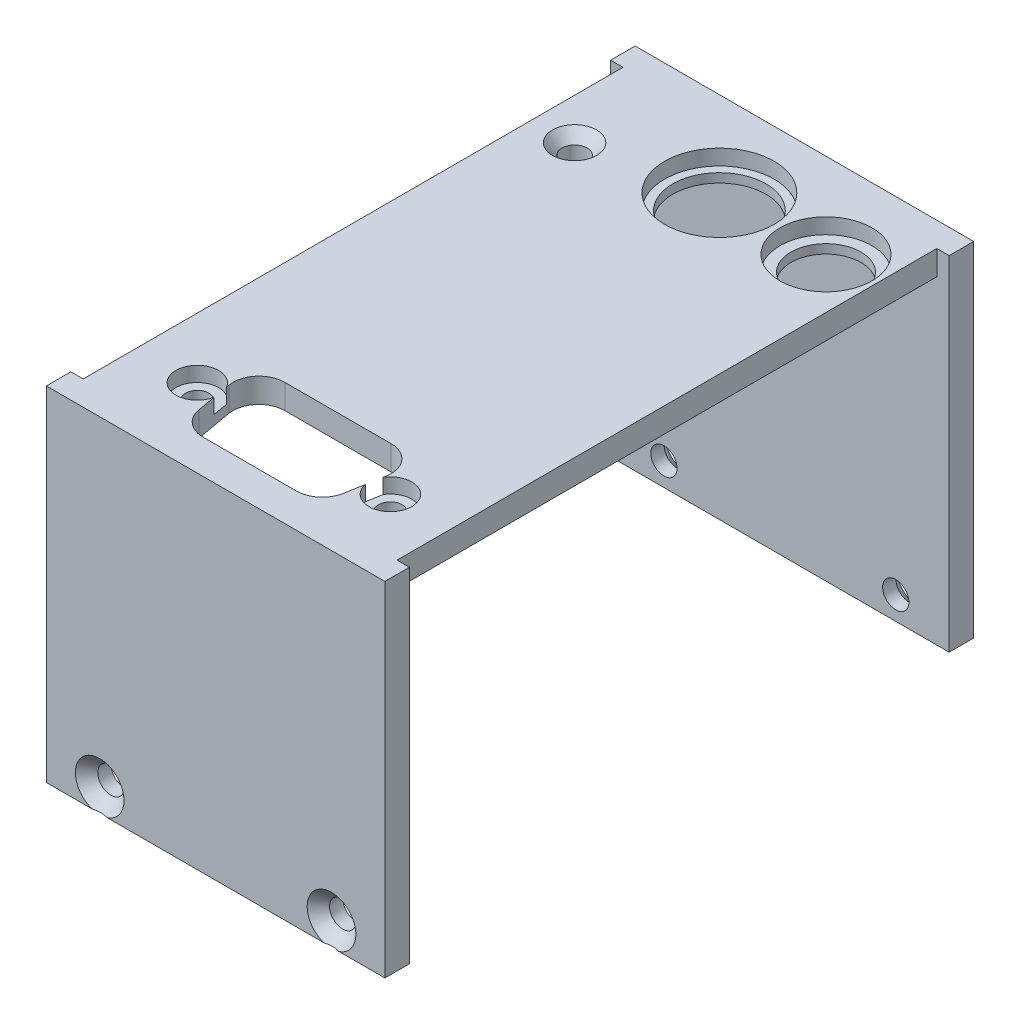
ISO-10303-21;
HEADER;
FILE_DESCRIPTION(('STEP AP214'),'2;1');
FILE_NAME('part.step','',(''),(''),'','','');
FILE_SCHEMA(('AUTOMOTIVE_DESIGN { 1 0 10303 214 1 1 1 1 }'));
ENDSEC;
DATA;
#1=APPLICATION_CONTEXT('core data for automotive mechanical design processes');
#2=APPLICATION_PROTOCOL_DEFINITION('international standard','automotive_design',2000,#1);
#3=PRODUCT_CONTEXT('',#1,'mechanical');
#4=PRODUCT('Part','Part','',(#3));
#5=PRODUCT_RELATED_PRODUCT_CATEGORY('part','',(#4));
#6=PRODUCT_DEFINITION_FORMATION('','',#4);
#7=PRODUCT_DEFINITION_CONTEXT('part definition',#1,'design');
#8=PRODUCT_DEFINITION('design','',#6,#7);
#9=PRODUCT_DEFINITION_SHAPE('','',#8);
#10=(LENGTH_UNIT() NAMED_UNIT(*) SI_UNIT(.MILLI.,.METRE.));
#11=(NAMED_UNIT(*) PLANE_ANGLE_UNIT() SI_UNIT($,.RADIAN.));
#12=(NAMED_UNIT(*) SI_UNIT($,.STERADIAN.) SOLID_ANGLE_UNIT());
#13=UNCERTAINTY_MEASURE_WITH_UNIT(LENGTH_MEASURE(1.E-05),#10,'distance_accuracy_value','');
#14=(GEOMETRIC_REPRESENTATION_CONTEXT(3) GLOBAL_UNCERTAINTY_ASSIGNED_CONTEXT((#13)) GLOBAL_UNIT_ASSIGNED_CONTEXT((#10,
#11,#12)) REPRESENTATION_CONTEXT('',''));
#15=CARTESIAN_POINT('',(0.,0.,0.));
#16=DIRECTION('',(0.,0.,1.));
#17=DIRECTION('',(1.,0.,0.));
#18=AXIS2_PLACEMENT_3D('',#15,#16,#17);
#19=CARTESIAN_POINT('',(21.9075,-50.8,38.1));
#20=DIRECTION('',(0.,0.,-1.));
#21=DIRECTION('',(0.,1.,0.));
#22=AXIS2_PLACEMENT_3D('',#19,#20,#21);
#23=PLANE('',#22);
#24=CARTESIAN_POINT('',(15.,-41.4528,38.1));
#25=DIRECTION('',(0.,0.,1.));
#26=DIRECTION('',(0.,-1.,0.));
#27=AXIS2_PLACEMENT_3D('',#24,#25,#26);
#28=CIRCLE('',#27,3.15);
#29=CARTESIAN_POINT('',(15.9691708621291,-44.45,38.1));
#30=VERTEX_POINT('',#29);
#31=CARTESIAN_POINT('',(14.0308291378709,-44.45,38.1));
#32=VERTEX_POINT('',#31);
#33=EDGE_CURVE('E58',#30,#32,#28,.T.);
#34=ORIENTED_EDGE('',*,*,#33,.F.);
#35=DIRECTION('',(1.,0.,0.));
#36=VECTOR('',#35,1.);
#37=CARTESIAN_POINT('',(21.9075,-44.45,38.1));
#38=LINE('',#37,#36);
#39=CARTESIAN_POINT('',(21.9075,-44.45,38.1));
#40=VERTEX_POINT('',#39);
#41=EDGE_CURVE('E254',#30,#40,#38,.T.);
#42=ORIENTED_EDGE('',*,*,#41,.T.);
#43=DIRECTION('',(0.,-1.,0.));
#44=VECTOR('',#43,1.);
#45=CARTESIAN_POINT('',(21.9075,-50.8,38.1));
#46=LINE('',#45,#44);
#47=CARTESIAN_POINT('',(21.9075,0.,38.1));
#48=VERTEX_POINT('',#47);
#49=EDGE_CURVE('E294',#48,#40,#46,.T.);
#50=ORIENTED_EDGE('',*,*,#49,.F.);
#51=DIRECTION('',(-1.,0.,0.));
#52=VECTOR('',#51,1.);
#53=CARTESIAN_POINT('',(21.9075,0.,38.1));
#54=LINE('',#53,#52);
#55=CARTESIAN_POINT('',(-21.9075,0.,38.1));
#56=VERTEX_POINT('',#55);
#57=EDGE_CURVE('E295',#48,#56,#54,.T.);
#58=ORIENTED_EDGE('',*,*,#57,.T.);
#59=DIRECTION('',(0.,-1.,0.));
#60=VECTOR('',#59,1.);
#61=CARTESIAN_POINT('',(-21.9075,-50.8,38.1));
#62=LINE('',#61,#60);
#63=CARTESIAN_POINT('',(-21.9075,-44.45,38.1));
#64=VERTEX_POINT('',#63);
#65=EDGE_CURVE('E271',#56,#64,#62,.T.);
#66=ORIENTED_EDGE('',*,*,#65,.T.);
#67=CARTESIAN_POINT('',(-15.9691708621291,-44.45,38.1));
#68=VERTEX_POINT('',#67);
#69=EDGE_CURVE('E265',#64,#68,#38,.T.);
#70=ORIENTED_EDGE('',*,*,#69,.T.);
#71=CARTESIAN_POINT('',(-15.,-41.4528,38.1));
#72=DIRECTION('',(0.,0.,1.));
#73=DIRECTION('',(0.,-1.,0.));
#74=AXIS2_PLACEMENT_3D('',#71,#72,#73);
#75=CIRCLE('',#74,3.15);
#76=CARTESIAN_POINT('',(-14.0308291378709,-44.45,38.1));
#77=VERTEX_POINT('',#76);
#78=EDGE_CURVE('E64',#77,#68,#75,.T.);
#79=ORIENTED_EDGE('',*,*,#78,.F.);
#80=EDGE_CURVE('E256',#77,#32,#38,.T.);
#81=ORIENTED_EDGE('',*,*,#80,.T.);
#82=EDGE_LOOP('',(#34,#42,#50,#58,#66,#70,#79,#81));
#83=FACE_BOUND('',#82,.T.);
#84=ADVANCED_FACE('F44',(#83),#23,.F.);
#85=CARTESIAN_POINT('',(-12.4968,-44.451,27.976945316));
#86=DIRECTION('',(0.,1.,0.));
#87=DIRECTION('',(0.,0.,1.));
#88=AXIS2_PLACEMENT_3D('',#85,#86,#87);
#89=CYLINDRICAL_SURFACE('',#88,1.524);
#90=CARTESIAN_POINT('',(-12.4968,-3.17500000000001,27.976945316));
#91=DIRECTION('',(0.,1.,0.));
#92=DIRECTION('',(0.,0.,1.));
#93=AXIS2_PLACEMENT_3D('',#90,#91,#92);
#94=CIRCLE('',#93,1.524);
#95=CARTESIAN_POINT('',(-12.4968,-3.17500000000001,29.500945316));
#96=VERTEX_POINT('',#95);
#97=EDGE_CURVE('E627',#96,#96,#94,.F.);
#98=ORIENTED_EDGE('',*,*,#97,.T.);
#99=EDGE_LOOP('',(#98));
#100=FACE_BOUND('',#99,.T.);
#101=CARTESIAN_POINT('',(-12.4968,-1.9304,27.976945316));
#102=DIRECTION('',(0.,1.,0.));
#103=DIRECTION('',(0.,0.,1.));
#104=AXIS2_PLACEMENT_3D('',#101,#102,#103);
#105=CIRCLE('',#104,1.524);
#106=CARTESIAN_POINT('',(-12.4968,-1.9304,29.500945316));
#107=VERTEX_POINT('',#106);
#108=EDGE_CURVE('E640',#107,#107,#105,.F.);
#109=ORIENTED_EDGE('',*,*,#108,.F.);
#110=EDGE_LOOP('',(#109));
#111=FACE_BOUND('',#110,.T.);
#112=ADVANCED_FACE('F354',(#100,#111),#89,.F.);
#113=CARTESIAN_POINT('',(12.4968,-44.451,27.976945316));
#114=DIRECTION('',(0.,1.,0.));
#115=DIRECTION('',(0.,0.,1.));
#116=AXIS2_PLACEMENT_3D('',#113,#114,#115);
#117=CYLINDRICAL_SURFACE('',#116,1.524);
#118=CARTESIAN_POINT('',(12.4968,-3.17500000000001,27.976945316));
#119=DIRECTION('',(0.,1.,0.));
#120=DIRECTION('',(0.,0.,1.));
#121=AXIS2_PLACEMENT_3D('',#118,#119,#120);
#122=CIRCLE('',#121,1.524);
#123=CARTESIAN_POINT('',(12.4968,-3.17500000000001,29.500945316));
#124=VERTEX_POINT('',#123);
#125=EDGE_CURVE('E624',#124,#124,#122,.F.);
#126=ORIENTED_EDGE('',*,*,#125,.T.);
#127=EDGE_LOOP('',(#126));
#128=FACE_BOUND('',#127,.T.);
#129=CARTESIAN_POINT('',(12.4968,-1.9304,27.976945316));
#130=DIRECTION('',(0.,1.,0.));
#131=DIRECTION('',(0.,0.,1.));
#132=AXIS2_PLACEMENT_3D('',#129,#130,#131);
#133=CIRCLE('',#132,1.524);
#134=CARTESIAN_POINT('',(12.4968,-1.9304,29.500945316));
#135=VERTEX_POINT('',#134);
#136=EDGE_CURVE('E632',#135,#135,#133,.F.);
#137=ORIENTED_EDGE('',*,*,#136,.F.);
#138=EDGE_LOOP('',(#137));
#139=FACE_BOUND('',#138,.T.);
#140=ADVANCED_FACE('F358',(#128,#139),#117,.F.);
#141=CARTESIAN_POINT('',(13.7925,-44.451,-27.1));
#142=DIRECTION('',(0.,1.,0.));
#143=DIRECTION('',(0.,0.,1.));
#144=AXIS2_PLACEMENT_3D('',#141,#142,#143);
#145=CYLINDRICAL_SURFACE('',#144,4.5339);
#146=CARTESIAN_POINT('',(13.7925,-3.17500000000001,-27.1));
#147=DIRECTION('',(0.,1.,0.));
#148=DIRECTION('',(0.,0.,1.));
#149=AXIS2_PLACEMENT_3D('',#146,#147,#148);
#150=CIRCLE('',#149,4.5339);
#151=CARTESIAN_POINT('',(13.7925,-3.17500000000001,-22.5661));
#152=VERTEX_POINT('',#151);
#153=EDGE_CURVE('E518',#152,#152,#150,.F.);
#154=ORIENTED_EDGE('',*,*,#153,.T.);
#155=EDGE_LOOP('',(#154));
#156=FACE_BOUND('',#155,.T.);
#157=CARTESIAN_POINT('',(13.7925,-2.0066,-27.1));
#158=DIRECTION('',(0.,1.,0.));
#159=DIRECTION('',(0.,0.,1.));
#160=AXIS2_PLACEMENT_3D('',#157,#158,#159);
#161=CIRCLE('',#160,4.5339);
#162=CARTESIAN_POINT('',(13.7925,-2.0066,-22.5661));
#163=VERTEX_POINT('',#162);
#164=EDGE_CURVE('E528',#163,#163,#161,.F.);
#165=ORIENTED_EDGE('',*,*,#164,.F.);
#166=EDGE_LOOP('',(#165));
#167=FACE_BOUND('',#166,.T.);
#168=ADVANCED_FACE('F364',(#156,#167),#145,.F.);
#169=CARTESIAN_POINT('',(0.,-44.451,-27.1));
#170=DIRECTION('',(0.,1.,0.));
#171=DIRECTION('',(0.,0.,1.));
#172=AXIS2_PLACEMENT_3D('',#169,#170,#171);
#173=CYLINDRICAL_SURFACE('',#172,6.0325);
#174=CARTESIAN_POINT('',(0.,-3.17500000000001,-27.1));
#175=DIRECTION('',(0.,1.,0.));
#176=DIRECTION('',(0.,0.,1.));
#177=AXIS2_PLACEMENT_3D('',#174,#175,#176);
#178=CIRCLE('',#177,6.0325);
#179=CARTESIAN_POINT('',(0.,-3.17500000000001,-21.0675));
#180=VERTEX_POINT('',#179);
#181=EDGE_CURVE('E445',#180,#180,#178,.F.);
#182=ORIENTED_EDGE('',*,*,#181,.T.);
#183=EDGE_LOOP('',(#182));
#184=FACE_BOUND('',#183,.T.);
#185=CARTESIAN_POINT('',(0.,-2.0066,-27.1));
#186=DIRECTION('',(0.,1.,0.));
#187=DIRECTION('',(0.,0.,1.));
#188=AXIS2_PLACEMENT_3D('',#185,#186,#187);
#189=CIRCLE('',#188,6.0325);
#190=CARTESIAN_POINT('',(0.,-2.0066,-21.0675));
#191=VERTEX_POINT('',#190);
#192=EDGE_CURVE('E522',#191,#191,#189,.F.);
#193=ORIENTED_EDGE('',*,*,#192,.F.);
#194=EDGE_LOOP('',(#193));
#195=FACE_BOUND('',#194,.T.);
#196=ADVANCED_FACE('F423',(#184,#195),#173,.F.);
#197=CARTESIAN_POINT('',(21.9075,0.,-38.1));
#198=DIRECTION('',(0.,0.,1.));
#199=DIRECTION('',(0.,-1.,0.));
#200=AXIS2_PLACEMENT_3D('',#197,#198,#199);
#201=PLANE('',#200);
#202=CARTESIAN_POINT('',(15.,-41.4528,-38.1));
#203=DIRECTION('',(0.,0.,-1.));
#204=DIRECTION('',(0.,1.,0.));
#205=AXIS2_PLACEMENT_3D('',#202,#203,#204);
#206=CIRCLE('',#205,3.15);
#207=CARTESIAN_POINT('',(14.0308291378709,-44.45,-38.1));
#208=VERTEX_POINT('',#207);
#209=CARTESIAN_POINT('',(15.9691708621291,-44.45,-38.1));
#210=VERTEX_POINT('',#209);
#211=EDGE_CURVE('E440',#208,#210,#206,.T.);
#212=ORIENTED_EDGE('',*,*,#211,.F.);
#213=DIRECTION('',(-1.,0.,0.));
#214=VECTOR('',#213,1.);
#215=CARTESIAN_POINT('',(21.9075,-44.45,-38.1));
#216=LINE('',#215,#214);
#217=CARTESIAN_POINT('',(-14.0308291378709,-44.45,-38.1));
#218=VERTEX_POINT('',#217);
#219=EDGE_CURVE('E450',#208,#218,#216,.T.);
#220=ORIENTED_EDGE('',*,*,#219,.T.);
#221=CARTESIAN_POINT('',(-15.,-41.4528,-38.1));
#222=DIRECTION('',(0.,0.,-1.));
#223=DIRECTION('',(0.,1.,0.));
#224=AXIS2_PLACEMENT_3D('',#221,#222,#223);
#225=CIRCLE('',#224,3.15);
#226=CARTESIAN_POINT('',(-15.9691708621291,-44.45,-38.1));
#227=VERTEX_POINT('',#226);
#228=EDGE_CURVE('E508',#227,#218,#225,.T.);
#229=ORIENTED_EDGE('',*,*,#228,.F.);
#230=CARTESIAN_POINT('',(-21.9075,-44.45,-38.1));
#231=VERTEX_POINT('',#230);
#232=EDGE_CURVE('E456',#227,#231,#216,.T.);
#233=ORIENTED_EDGE('',*,*,#232,.T.);
#234=DIRECTION('',(0.,1.,0.));
#235=VECTOR('',#234,1.);
#236=CARTESIAN_POINT('',(-21.9075,0.,-38.1));
#237=LINE('',#236,#235);
#238=CARTESIAN_POINT('',(-21.9075,0.,-38.1));
#239=VERTEX_POINT('',#238);
#240=EDGE_CURVE('E286',#231,#239,#237,.T.);
#241=ORIENTED_EDGE('',*,*,#240,.T.);
#242=DIRECTION('',(-1.,0.,0.));
#243=VECTOR('',#242,1.);
#244=CARTESIAN_POINT('',(21.9075,0.,-38.1));
#245=LINE('',#244,#243);
#246=CARTESIAN_POINT('',(21.9075,0.,-38.1));
#247=VERTEX_POINT('',#246);
#248=EDGE_CURVE('E298',#247,#239,#245,.T.);
#249=ORIENTED_EDGE('',*,*,#248,.F.);
#250=DIRECTION('',(0.,1.,0.));
#251=VECTOR('',#250,1.);
#252=CARTESIAN_POINT('',(21.9075,0.,-38.1));
#253=LINE('',#252,#251);
#254=CARTESIAN_POINT('',(21.9075,-44.45,-38.1));
#255=VERTEX_POINT('',#254);
#256=EDGE_CURVE('E454',#255,#247,#253,.T.);
#257=ORIENTED_EDGE('',*,*,#256,.F.);
#258=EDGE_CURVE('E448',#255,#210,#216,.T.);
#259=ORIENTED_EDGE('',*,*,#258,.T.);
#260=EDGE_LOOP('',(#212,#220,#229,#233,#241,#249,#257,#259));
#261=FACE_BOUND('',#260,.T.);
#262=ADVANCED_FACE('F426',(#261),#201,.F.);
#263=CARTESIAN_POINT('',(-21.9075,0.,38.1));
#264=DIRECTION('',(-1.,0.,0.));
#265=DIRECTION('',(0.,0.,1.));
#266=AXIS2_PLACEMENT_3D('',#263,#264,#265);
#267=PLANE('',#266);
#268=DIRECTION('',(0.,0.,1.));
#269=VECTOR('',#268,1.);
#270=CARTESIAN_POINT('',(-21.9075,0.,38.1));
#271=LINE('',#270,#269);
#272=CARTESIAN_POINT('',(-21.9075,0.,34.925));
#273=VERTEX_POINT('',#272);
#274=EDGE_CURVE('E289',#273,#56,#271,.T.);
#275=ORIENTED_EDGE('',*,*,#274,.F.);
#276=DIRECTION('',(0.,1.,0.));
#277=VECTOR('',#276,1.);
#278=CARTESIAN_POINT('',(-21.9075,-3.17500000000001,34.925));
#279=LINE('',#278,#277);
#280=CARTESIAN_POINT('',(-21.9075,-44.45,34.925));
#281=VERTEX_POINT('',#280);
#282=EDGE_CURVE('E273',#281,#273,#279,.T.);
#283=ORIENTED_EDGE('',*,*,#282,.F.);
#284=DIRECTION('',(0.,0.,-1.));
#285=VECTOR('',#284,1.);
#286=CARTESIAN_POINT('',(-21.9075,-44.45,38.1));
#287=LINE('',#286,#285);
#288=EDGE_CURVE('E313',#64,#281,#287,.T.);
#289=ORIENTED_EDGE('',*,*,#288,.F.);
#290=ORIENTED_EDGE('',*,*,#65,.F.);
#291=EDGE_LOOP('',(#275,#283,#289,#290));
#292=FACE_BOUND('',#291,.T.);
#293=ADVANCED_FACE('F722',(#292),#267,.T.);
#294=CARTESIAN_POINT('',(21.9075,0.,38.1));
#295=DIRECTION('',(-1.,0.,0.));
#296=DIRECTION('',(0.,0.,1.));
#297=AXIS2_PLACEMENT_3D('',#294,#295,#296);
#298=PLANE('',#297);
#299=DIRECTION('',(0.,0.,1.));
#300=VECTOR('',#299,1.);
#301=CARTESIAN_POINT('',(21.9075,0.,38.1));
#302=LINE('',#301,#300);
#303=CARTESIAN_POINT('',(21.9075,0.,-34.925));
#304=VERTEX_POINT('',#303);
#305=EDGE_CURVE('E280',#247,#304,#302,.T.);
#306=ORIENTED_EDGE('',*,*,#305,.T.);
#307=DIRECTION('',(0.,-1.,0.));
#308=VECTOR('',#307,1.);
#309=CARTESIAN_POINT('',(21.9075,-50.8,-34.925));
#310=LINE('',#309,#308);
#311=CARTESIAN_POINT('',(21.9075,-44.45,-34.925));
#312=VERTEX_POINT('',#311);
#313=EDGE_CURVE('E703',#304,#312,#310,.T.);
#314=ORIENTED_EDGE('',*,*,#313,.T.);
#315=DIRECTION('',(0.,0.,1.));
#316=VECTOR('',#315,1.);
#317=CARTESIAN_POINT('',(21.9075,-44.45,46.8158381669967));
#318=LINE('',#317,#316);
#319=EDGE_CURVE('E460',#255,#312,#318,.T.);
#320=ORIENTED_EDGE('',*,*,#319,.F.);
#321=ORIENTED_EDGE('',*,*,#256,.T.);
#322=EDGE_LOOP('',(#306,#314,#320,#321));
#323=FACE_BOUND('',#322,.T.);
#324=ADVANCED_FACE('F708',(#323),#298,.F.);
#325=CARTESIAN_POINT('',(21.9075,-3.17500000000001,34.925));
#326=DIRECTION('',(0.,0.,1.));
#327=DIRECTION('',(0.,-1.,0.));
#328=AXIS2_PLACEMENT_3D('',#325,#326,#327);
#329=PLANE('',#328);
#330=CARTESIAN_POINT('',(15.,-41.4528,34.925));
#331=DIRECTION('',(0.,0.,1.));
#332=DIRECTION('',(0.,-1.,0.));
#333=AXIS2_PLACEMENT_3D('',#330,#331,#332);
#334=CIRCLE('',#333,1.69999999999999);
#335=CARTESIAN_POINT('',(15.,-43.1528,34.925));
#336=VERTEX_POINT('',#335);
#337=EDGE_CURVE('E654',#336,#336,#334,.T.);
#338=ORIENTED_EDGE('',*,*,#337,.T.);
#339=EDGE_LOOP('',(#338));
#340=FACE_BOUND('',#339,.T.);
#341=CARTESIAN_POINT('',(-15.,-41.4528,34.925));
#342=DIRECTION('',(0.,0.,1.));
#343=DIRECTION('',(0.,-1.,0.));
#344=AXIS2_PLACEMENT_3D('',#341,#342,#343);
#345=CIRCLE('',#344,1.69999999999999);
#346=CARTESIAN_POINT('',(-15.,-43.1528,34.925));
#347=VERTEX_POINT('',#346);
#348=EDGE_CURVE('E645',#347,#347,#345,.T.);
#349=ORIENTED_EDGE('',*,*,#348,.T.);
#350=EDGE_LOOP('',(#349));
#351=FACE_BOUND('',#350,.T.);
#352=DIRECTION('',(0.,1.,0.));
#353=VECTOR('',#352,1.);
#354=CARTESIAN_POINT('',(21.9075,-3.17500000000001,34.925));
#355=LINE('',#354,#353);
#356=CARTESIAN_POINT('',(21.9075,-44.45,34.925));
#357=VERTEX_POINT('',#356);
#358=CARTESIAN_POINT('',(21.9075,0.,34.925));
#359=VERTEX_POINT('',#358);
#360=EDGE_CURVE('E717',#357,#359,#355,.T.);
#361=ORIENTED_EDGE('',*,*,#360,.F.);
#362=DIRECTION('',(-1.,0.,0.));
#363=VECTOR('',#362,1.);
#364=CARTESIAN_POINT('',(21.9075,-44.45,34.925));
#365=LINE('',#364,#363);
#366=EDGE_CURVE('E263',#357,#281,#365,.T.);
#367=ORIENTED_EDGE('',*,*,#366,.T.);
#368=ORIENTED_EDGE('',*,*,#282,.T.);
#369=DIRECTION('',(1.,0.,0.));
#370=VECTOR('',#369,1.);
#371=CARTESIAN_POINT('',(-20.3075,0.,34.925));
#372=LINE('',#371,#370);
#373=CARTESIAN_POINT('',(-20.3075,0.,34.925));
#374=VERTEX_POINT('',#373);
#375=EDGE_CURVE('E488',#273,#374,#372,.T.);
#376=ORIENTED_EDGE('',*,*,#375,.T.);
#377=DIRECTION('',(0.,1.,0.));
#378=VECTOR('',#377,1.);
#379=CARTESIAN_POINT('',(-20.3075,-73.8850502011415,34.925));
#380=LINE('',#379,#378);
#381=CARTESIAN_POINT('',(-20.3075,-3.17500000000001,34.925));
#382=VERTEX_POINT('',#381);
#383=EDGE_CURVE('E487',#382,#374,#380,.T.);
#384=ORIENTED_EDGE('',*,*,#383,.F.);
#385=DIRECTION('',(-1.,0.,0.));
#386=VECTOR('',#385,1.);
#387=CARTESIAN_POINT('',(21.9075,-3.17500000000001,34.925));
#388=LINE('',#387,#386);
#389=CARTESIAN_POINT('',(20.3075,-3.17500000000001,34.925));
#390=VERTEX_POINT('',#389);
#391=EDGE_CURVE('E306',#390,#382,#388,.T.);
#392=ORIENTED_EDGE('',*,*,#391,.F.);
#393=DIRECTION('',(0.,1.,0.));
#394=VECTOR('',#393,1.);
#395=CARTESIAN_POINT('',(20.3075,-73.8850502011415,34.925));
#396=LINE('',#395,#394);
#397=CARTESIAN_POINT('',(20.3075,0.,34.925));
#398=VERTEX_POINT('',#397);
#399=EDGE_CURVE('E465',#390,#398,#396,.T.);
#400=ORIENTED_EDGE('',*,*,#399,.T.);
#401=DIRECTION('',(1.,0.,0.));
#402=VECTOR('',#401,1.);
#403=CARTESIAN_POINT('',(20.3075,0.,34.925));
#404=LINE('',#403,#402);
#405=EDGE_CURVE('E474',#398,#359,#404,.T.);
#406=ORIENTED_EDGE('',*,*,#405,.T.);
#407=EDGE_LOOP('',(#361,#367,#368,#376,#384,#392,#400,#406));
#408=FACE_BOUND('',#407,.T.);
#409=ADVANCED_FACE('F693',(#340,#351,#408),#329,.F.);
#410=CARTESIAN_POINT('',(21.9075,-3.17500000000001,-34.925));
#411=DIRECTION('',(0.,1.,0.));
#412=DIRECTION('',(0.,0.,1.));
#413=AXIS2_PLACEMENT_3D('',#410,#411,#412);
#414=PLANE('',#413);
#415=CARTESIAN_POINT('',(-14.986,-3.17500000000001,-23.3472848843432));
#416=DIRECTION('',(0.,1.,0.));
#417=DIRECTION('',(0.,0.,1.));
#418=AXIS2_PLACEMENT_3D('',#415,#416,#417);
#419=CIRCLE('',#418,1.63194999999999);
#420=CARTESIAN_POINT('',(-14.986,-3.17500000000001,-21.7153348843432));
#421=VERTEX_POINT('',#420);
#422=EDGE_CURVE('E47',#421,#421,#419,.T.);
#423=ORIENTED_EDGE('',*,*,#422,.T.);
#424=EDGE_LOOP('',(#423));
#425=FACE_BOUND('',#424,.T.);
#426=ORIENTED_EDGE('',*,*,#97,.F.);
#427=EDGE_LOOP('',(#426));
#428=FACE_BOUND('',#427,.T.);
#429=ORIENTED_EDGE('',*,*,#125,.F.);
#430=EDGE_LOOP('',(#429));
#431=FACE_BOUND('',#430,.T.);
#432=DIRECTION('',(-0.173648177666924,0.,-0.98480775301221));
#433=VECTOR('',#432,1.);
#434=CARTESIAN_POINT('',(-9.3522242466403,-3.17500000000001,30.9213529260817));
#435=LINE('',#434,#433);
#436=CARTESIAN_POINT('',(-9.3522242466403,-3.17500000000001,30.9213529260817));
#437=VERTEX_POINT('',#436);
#438=CARTESIAN_POINT('',(-10.1852634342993,-3.17500000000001,26.1969529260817));
#439=VERTEX_POINT('',#438);
#440=EDGE_CURVE('E603',#437,#439,#435,.T.);
#441=ORIENTED_EDGE('',*,*,#440,.F.);
#442=CARTESIAN_POINT('',(-6.05036081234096,-3.17500000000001,30.339145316));
#443=DIRECTION('',(0.,1.,0.));
#444=DIRECTION('',(0.,0.,1.));
#445=AXIS2_PLACEMENT_3D('',#442,#443,#444);
#446=CIRCLE('',#445,3.3528);
#447=CARTESIAN_POINT('',(-6.05036081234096,-3.17500000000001,33.691945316));
#448=VERTEX_POINT('',#447);
#449=EDGE_CURVE('E599',#448,#437,#446,.F.);
#450=ORIENTED_EDGE('',*,*,#449,.F.);
#451=DIRECTION('',(-1.,0.,0.));
#452=VECTOR('',#451,1.);
#453=CARTESIAN_POINT('',(6.05036081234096,-3.17500000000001,33.691945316));
#454=LINE('',#453,#452);
#455=CARTESIAN_POINT('',(6.05036081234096,-3.17500000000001,33.691945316));
#456=VERTEX_POINT('',#455);
#457=EDGE_CURVE('E537',#456,#448,#454,.T.);
#458=ORIENTED_EDGE('',*,*,#457,.F.);
#459=CARTESIAN_POINT('',(6.05036081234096,-3.17500000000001,30.339145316));
#460=DIRECTION('',(0.,1.,0.));
#461=DIRECTION('',(0.,0.,1.));
#462=AXIS2_PLACEMENT_3D('',#459,#460,#461);
#463=CIRCLE('',#462,3.3528);
#464=CARTESIAN_POINT('',(9.3522242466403,-3.17500000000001,30.9213529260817));
#465=VERTEX_POINT('',#464);
#466=EDGE_CURVE('E621',#465,#456,#463,.F.);
#467=ORIENTED_EDGE('',*,*,#466,.F.);
#468=DIRECTION('',(-0.173648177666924,0.,0.98480775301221));
#469=VECTOR('',#468,1.);
#470=CARTESIAN_POINT('',(10.1852634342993,-3.17500000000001,26.1969529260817));
#471=LINE('',#470,#469);
#472=CARTESIAN_POINT('',(10.1852634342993,-3.17500000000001,26.1969529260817));
#473=VERTEX_POINT('',#472);
#474=EDGE_CURVE('E618',#473,#465,#471,.T.);
#475=ORIENTED_EDGE('',*,*,#474,.F.);
#476=CARTESIAN_POINT('',(6.8834,-3.17500000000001,25.614745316));
#477=DIRECTION('',(0.,1.,0.));
#478=DIRECTION('',(0.,0.,1.));
#479=AXIS2_PLACEMENT_3D('',#476,#477,#478);
#480=CIRCLE('',#479,3.3528);
#481=CARTESIAN_POINT('',(6.8834,-3.17500000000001,22.261945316));
#482=VERTEX_POINT('',#481);
#483=EDGE_CURVE('E615',#482,#473,#480,.F.);
#484=ORIENTED_EDGE('',*,*,#483,.F.);
#485=DIRECTION('',(1.,0.,0.));
#486=VECTOR('',#485,1.);
#487=CARTESIAN_POINT('',(-6.8834,-3.17500000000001,22.261945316));
#488=LINE('',#487,#486);
#489=CARTESIAN_POINT('',(-6.8834,-3.17500000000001,22.261945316));
#490=VERTEX_POINT('',#489);
#491=EDGE_CURVE('E611',#490,#482,#488,.T.);
#492=ORIENTED_EDGE('',*,*,#491,.F.);
#493=CARTESIAN_POINT('',(-6.8834,-3.17500000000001,25.614745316));
#494=DIRECTION('',(0.,1.,0.));
#495=DIRECTION('',(0.,0.,1.));
#496=AXIS2_PLACEMENT_3D('',#493,#494,#495);
#497=CIRCLE('',#496,3.35280000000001);
#498=EDGE_CURVE('E607',#439,#490,#497,.F.);
#499=ORIENTED_EDGE('',*,*,#498,.F.);
#500=EDGE_LOOP('',(#441,#450,#458,#467,#475,#484,#492,#499));
#501=FACE_BOUND('',#500,.T.);
#502=ORIENTED_EDGE('',*,*,#153,.F.);
#503=EDGE_LOOP('',(#502));
#504=FACE_BOUND('',#503,.T.);
#505=ORIENTED_EDGE('',*,*,#181,.F.);
#506=EDGE_LOOP('',(#505));
#507=FACE_BOUND('',#506,.T.);
#508=ORIENTED_EDGE('',*,*,#391,.T.);
#509=DIRECTION('',(0.,0.,1.));
#510=VECTOR('',#509,1.);
#511=CARTESIAN_POINT('',(-20.3075,-3.17500000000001,-34.925));
#512=LINE('',#511,#510);
#513=CARTESIAN_POINT('',(-20.3075,-3.17500000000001,-34.925));
#514=VERTEX_POINT('',#513);
#515=EDGE_CURVE('E481',#514,#382,#512,.T.);
#516=ORIENTED_EDGE('',*,*,#515,.F.);
#517=DIRECTION('',(-1.,0.,0.));
#518=VECTOR('',#517,1.);
#519=CARTESIAN_POINT('',(21.9075,-3.17500000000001,-34.925));
#520=LINE('',#519,#518);
#521=CARTESIAN_POINT('',(20.3075,-3.17500000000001,-34.925));
#522=VERTEX_POINT('',#521);
#523=EDGE_CURVE('E302',#522,#514,#520,.T.);
#524=ORIENTED_EDGE('',*,*,#523,.F.);
#525=DIRECTION('',(0.,0.,-1.));
#526=VECTOR('',#525,1.);
#527=CARTESIAN_POINT('',(20.3075,-3.17500000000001,-34.925));
#528=LINE('',#527,#526);
#529=EDGE_CURVE('E463',#390,#522,#528,.T.);
#530=ORIENTED_EDGE('',*,*,#529,.F.);
#531=EDGE_LOOP('',(#508,#516,#524,#530));
#532=FACE_BOUND('',#531,.T.);
#533=ADVANCED_FACE('F696',(#425,#428,#431,#501,#504,#507,#532),#414,.F.);
#534=CARTESIAN_POINT('',(21.9075,-50.8,-34.925));
#535=DIRECTION('',(0.,0.,-1.));
#536=DIRECTION('',(-1.,0.,0.));
#537=AXIS2_PLACEMENT_3D('',#534,#535,#536);
#538=PLANE('',#537);
#539=CARTESIAN_POINT('',(15.,-41.4528,-34.925));
#540=DIRECTION('',(0.,0.,-1.));
#541=DIRECTION('',(-1.,0.,0.));
#542=AXIS2_PLACEMENT_3D('',#539,#540,#541);
#543=CIRCLE('',#542,1.69999999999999);
#544=CARTESIAN_POINT('',(13.3,-41.4528,-34.925));
#545=VERTEX_POINT('',#544);
#546=EDGE_CURVE('E511',#545,#545,#543,.T.);
#547=ORIENTED_EDGE('',*,*,#546,.T.);
#548=EDGE_LOOP('',(#547));
#549=FACE_BOUND('',#548,.T.);
#550=CARTESIAN_POINT('',(-15.,-41.4528,-34.925));
#551=DIRECTION('',(0.,0.,-1.));
#552=DIRECTION('',(-1.,0.,0.));
#553=AXIS2_PLACEMENT_3D('',#550,#551,#552);
#554=CIRCLE('',#553,1.69999999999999);
#555=CARTESIAN_POINT('',(-16.7,-41.4528,-34.925));
#556=VERTEX_POINT('',#555);
#557=EDGE_CURVE('E500',#556,#556,#554,.T.);
#558=ORIENTED_EDGE('',*,*,#557,.T.);
#559=EDGE_LOOP('',(#558));
#560=FACE_BOUND('',#559,.T.);
#561=DIRECTION('',(0.,-1.,0.));
#562=VECTOR('',#561,1.);
#563=CARTESIAN_POINT('',(-21.9075,-50.8,-34.925));
#564=LINE('',#563,#562);
#565=CARTESIAN_POINT('',(-21.9075,0.,-34.925));
#566=VERTEX_POINT('',#565);
#567=CARTESIAN_POINT('',(-21.9075,-44.45,-34.925));
#568=VERTEX_POINT('',#567);
#569=EDGE_CURVE('E277',#566,#568,#564,.T.);
#570=ORIENTED_EDGE('',*,*,#569,.T.);
#571=DIRECTION('',(1.,0.,0.));
#572=VECTOR('',#571,1.);
#573=CARTESIAN_POINT('',(21.9075,-44.45,-34.925));
#574=LINE('',#573,#572);
#575=EDGE_CURVE('E267',#568,#312,#574,.T.);
#576=ORIENTED_EDGE('',*,*,#575,.T.);
#577=ORIENTED_EDGE('',*,*,#313,.F.);
#578=DIRECTION('',(-1.,0.,0.));
#579=VECTOR('',#578,1.);
#580=CARTESIAN_POINT('',(20.3075,0.,-34.925));
#581=LINE('',#580,#579);
#582=CARTESIAN_POINT('',(20.3075,0.,-34.925));
#583=VERTEX_POINT('',#582);
#584=EDGE_CURVE('E468',#304,#583,#581,.T.);
#585=ORIENTED_EDGE('',*,*,#584,.T.);
#586=DIRECTION('',(0.,1.,0.));
#587=VECTOR('',#586,1.);
#588=CARTESIAN_POINT('',(20.3075,-73.8850502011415,-34.9250000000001));
#589=LINE('',#588,#587);
#590=EDGE_CURVE('E467',#522,#583,#589,.T.);
#591=ORIENTED_EDGE('',*,*,#590,.F.);
#592=ORIENTED_EDGE('',*,*,#523,.T.);
#593=DIRECTION('',(0.,1.,0.));
#594=VECTOR('',#593,1.);
#595=CARTESIAN_POINT('',(-20.3075,-73.8850502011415,-34.9250000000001));
#596=LINE('',#595,#594);
#597=CARTESIAN_POINT('',(-20.3075,0.,-34.925));
#598=VERTEX_POINT('',#597);
#599=EDGE_CURVE('E484',#514,#598,#596,.T.);
#600=ORIENTED_EDGE('',*,*,#599,.T.);
#601=DIRECTION('',(-1.,0.,0.));
#602=VECTOR('',#601,1.);
#603=CARTESIAN_POINT('',(-20.3075,0.,-34.925));
#604=LINE('',#603,#602);
#605=EDGE_CURVE('E492',#598,#566,#604,.T.);
#606=ORIENTED_EDGE('',*,*,#605,.T.);
#607=EDGE_LOOP('',(#570,#576,#577,#585,#591,#592,#600,#606));
#608=FACE_BOUND('',#607,.T.);
#609=ADVANCED_FACE('F674',(#549,#560,#608),#538,.F.);
#610=CARTESIAN_POINT('',(21.9075,0.,38.1));
#611=DIRECTION('',(0.,-1.,0.));
#612=DIRECTION('',(0.,0.,-1.));
#613=AXIS2_PLACEMENT_3D('',#610,#611,#612);
#614=PLANE('',#613);
#615=CARTESIAN_POINT('',(-14.986,0.,-23.3472848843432));
#616=DIRECTION('',(0.,1.,0.));
#617=DIRECTION('',(0.,0.,1.));
#618=AXIS2_PLACEMENT_3D('',#615,#616,#617);
#619=CIRCLE('',#618,2.8575);
#620=CARTESIAN_POINT('',(-14.986,0.,-20.4897848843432));
#621=VERTEX_POINT('',#620);
#622=EDGE_CURVE('E663',#621,#621,#619,.T.);
#623=ORIENTED_EDGE('',*,*,#622,.F.);
#624=EDGE_LOOP('',(#623));
#625=FACE_BOUND('',#624,.T.);
#626=DIRECTION('',(0.173648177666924,0.,0.98480775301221));
#627=VECTOR('',#626,1.);
#628=CARTESIAN_POINT('',(-9.3522242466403,0.,30.9213529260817));
#629=LINE('',#628,#627);
#630=CARTESIAN_POINT('',(-9.77864104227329,0.,28.5030231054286));
#631=VERTEX_POINT('',#630);
#632=CARTESIAN_POINT('',(-9.3522242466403,0.,30.9213529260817));
#633=VERTEX_POINT('',#632);
#634=EDGE_CURVE('E572',#631,#633,#629,.T.);
#635=ORIENTED_EDGE('',*,*,#634,.F.);
#636=CARTESIAN_POINT('',(-12.4968,0.,27.976945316));
#637=DIRECTION('',(0.,1.,0.));
#638=DIRECTION('',(0.,0.,1.));
#639=AXIS2_PLACEMENT_3D('',#636,#637,#638);
#640=CIRCLE('',#639,2.7686);
#641=CARTESIAN_POINT('',(-10.1224952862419,0.,26.552928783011));
#642=VERTEX_POINT('',#641);
#643=EDGE_CURVE('E641',#642,#631,#640,.T.);
#644=ORIENTED_EDGE('',*,*,#643,.F.);
#645=CARTESIAN_POINT('',(-10.1852634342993,0.,26.1969529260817));
#646=VERTEX_POINT('',#645);
#647=EDGE_CURVE('E550',#646,#642,#629,.T.);
#648=ORIENTED_EDGE('',*,*,#647,.F.);
#649=CARTESIAN_POINT('',(-6.8834,0.,25.614745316));
#650=DIRECTION('',(0.,1.,0.));
#651=DIRECTION('',(0.,0.,1.));
#652=AXIS2_PLACEMENT_3D('',#649,#650,#651);
#653=CIRCLE('',#652,3.35280000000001);
#654=CARTESIAN_POINT('',(-6.8834,0.,22.261945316));
#655=VERTEX_POINT('',#654);
#656=EDGE_CURVE('E573',#655,#646,#653,.T.);
#657=ORIENTED_EDGE('',*,*,#656,.F.);
#658=DIRECTION('',(-1.,0.,0.));
#659=VECTOR('',#658,1.);
#660=CARTESIAN_POINT('',(-6.8834,0.,22.261945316));
#661=LINE('',#660,#659);
#662=CARTESIAN_POINT('',(6.8834,0.,22.261945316));
#663=VERTEX_POINT('',#662);
#664=EDGE_CURVE('E577',#663,#655,#661,.T.);
#665=ORIENTED_EDGE('',*,*,#664,.F.);
#666=CARTESIAN_POINT('',(6.8834,0.,25.614745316));
#667=DIRECTION('',(0.,1.,0.));
#668=DIRECTION('',(0.,0.,-1.));
#669=AXIS2_PLACEMENT_3D('',#666,#667,#668);
#670=CIRCLE('',#669,3.3528);
#671=CARTESIAN_POINT('',(10.1852634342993,0.,26.1969529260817));
#672=VERTEX_POINT('',#671);
#673=EDGE_CURVE('E581',#672,#663,#670,.T.);
#674=ORIENTED_EDGE('',*,*,#673,.F.);
#675=DIRECTION('',(0.173648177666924,0.,-0.98480775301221));
#676=VECTOR('',#675,1.);
#677=CARTESIAN_POINT('',(10.1852634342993,0.,26.1969529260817));
#678=LINE('',#677,#676);
#679=CARTESIAN_POINT('',(10.1224952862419,0.,26.552928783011));
#680=VERTEX_POINT('',#679);
#681=EDGE_CURVE('E587',#680,#672,#678,.T.);
#682=ORIENTED_EDGE('',*,*,#681,.F.);
#683=CARTESIAN_POINT('',(12.4968,0.,27.976945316));
#684=DIRECTION('',(0.,1.,0.));
#685=DIRECTION('',(0.,0.,1.));
#686=AXIS2_PLACEMENT_3D('',#683,#684,#685);
#687=CIRCLE('',#686,2.7686);
#688=CARTESIAN_POINT('',(9.77864104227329,0.,28.5030231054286));
#689=VERTEX_POINT('',#688);
#690=EDGE_CURVE('E633',#689,#680,#687,.T.);
#691=ORIENTED_EDGE('',*,*,#690,.F.);
#692=CARTESIAN_POINT('',(9.3522242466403,0.,30.9213529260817));
#693=VERTEX_POINT('',#692);
#694=EDGE_CURVE('E584',#693,#689,#678,.T.);
#695=ORIENTED_EDGE('',*,*,#694,.F.);
#696=CARTESIAN_POINT('',(6.05036081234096,0.,30.339145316));
#697=DIRECTION('',(0.,1.,0.));
#698=DIRECTION('',(0.,0.,-1.));
#699=AXIS2_PLACEMENT_3D('',#696,#697,#698);
#700=CIRCLE('',#699,3.3528);
#701=CARTESIAN_POINT('',(6.05036081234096,0.,33.691945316));
#702=VERTEX_POINT('',#701);
#703=EDGE_CURVE('E588',#702,#693,#700,.T.);
#704=ORIENTED_EDGE('',*,*,#703,.F.);
#705=DIRECTION('',(1.,0.,0.));
#706=VECTOR('',#705,1.);
#707=CARTESIAN_POINT('',(6.05036081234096,0.,33.691945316));
#708=LINE('',#707,#706);
#709=CARTESIAN_POINT('',(-6.05036081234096,0.,33.691945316));
#710=VERTEX_POINT('',#709);
#711=EDGE_CURVE('E592',#710,#702,#708,.T.);
#712=ORIENTED_EDGE('',*,*,#711,.F.);
#713=CARTESIAN_POINT('',(-6.05036081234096,0.,30.339145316));
#714=DIRECTION('',(0.,1.,0.));
#715=DIRECTION('',(0.,0.,-1.));
#716=AXIS2_PLACEMENT_3D('',#713,#714,#715);
#717=CIRCLE('',#716,3.3528);
#718=EDGE_CURVE('E596',#633,#710,#717,.T.);
#719=ORIENTED_EDGE('',*,*,#718,.F.);
#720=EDGE_LOOP('',(#635,#644,#648,#657,#665,#674,#682,#691,#695,#704,#712,#719));
#721=FACE_BOUND('',#720,.T.);
#722=CARTESIAN_POINT('',(13.7925,0.,-27.1));
#723=DIRECTION('',(0.,1.,0.));
#724=DIRECTION('',(0.,0.,1.));
#725=AXIS2_PLACEMENT_3D('',#722,#723,#724);
#726=CIRCLE('',#725,5.953125);
#727=CARTESIAN_POINT('',(13.7925,0.,-21.146875));
#728=VERTEX_POINT('',#727);
#729=EDGE_CURVE('E532',#728,#728,#726,.T.);
#730=ORIENTED_EDGE('',*,*,#729,.F.);
#731=EDGE_LOOP('',(#730));
#732=FACE_BOUND('',#731,.T.);
#733=CARTESIAN_POINT('',(0.,0.,-27.1));
#734=DIRECTION('',(0.,1.,0.));
#735=DIRECTION('',(0.,0.,1.));
#736=AXIS2_PLACEMENT_3D('',#733,#734,#735);
#737=CIRCLE('',#736,7.0866);
#738=CARTESIAN_POINT('',(0.,0.,-20.0134));
#739=VERTEX_POINT('',#738);
#740=EDGE_CURVE('E523',#739,#739,#737,.T.);
#741=ORIENTED_EDGE('',*,*,#740,.F.);
#742=EDGE_LOOP('',(#741));
#743=FACE_BOUND('',#742,.T.);
#744=DIRECTION('',(0.,0.,-1.));
#745=VECTOR('',#744,1.);
#746=CARTESIAN_POINT('',(-20.3075,0.,-34.925));
#747=LINE('',#746,#745);
#748=EDGE_CURVE('E496',#374,#598,#747,.T.);
#749=ORIENTED_EDGE('',*,*,#748,.F.);
#750=ORIENTED_EDGE('',*,*,#375,.F.);
#751=ORIENTED_EDGE('',*,*,#274,.T.);
#752=ORIENTED_EDGE('',*,*,#57,.F.);
#753=EDGE_CURVE('E710',#359,#48,#302,.T.);
#754=ORIENTED_EDGE('',*,*,#753,.F.);
#755=ORIENTED_EDGE('',*,*,#405,.F.);
#756=DIRECTION('',(0.,0.,1.));
#757=VECTOR('',#756,1.);
#758=CARTESIAN_POINT('',(20.3075,0.,-34.925));
#759=LINE('',#758,#757);
#760=EDGE_CURVE('E477',#583,#398,#759,.T.);
#761=ORIENTED_EDGE('',*,*,#760,.F.);
#762=ORIENTED_EDGE('',*,*,#584,.F.);
#763=ORIENTED_EDGE('',*,*,#305,.F.);
#764=ORIENTED_EDGE('',*,*,#248,.T.);
#765=EDGE_CURVE('E290',#239,#566,#271,.T.);
#766=ORIENTED_EDGE('',*,*,#765,.T.);
#767=ORIENTED_EDGE('',*,*,#605,.F.);
#768=EDGE_LOOP('',(#749,#750,#751,#752,#754,#755,#761,#762,#763,#764,#766,#767));
#769=FACE_BOUND('',#768,.T.);
#770=ADVANCED_FACE('F670',(#625,#721,#732,#743,#769),#614,.F.);
#771=ORIENTED_EDGE('',*,*,#360,.T.);
#772=ORIENTED_EDGE('',*,*,#753,.T.);
#773=ORIENTED_EDGE('',*,*,#49,.T.);
#774=EDGE_CURVE('E261',#357,#40,#318,.T.);
#775=ORIENTED_EDGE('',*,*,#774,.F.);
#776=EDGE_LOOP('',(#771,#772,#773,#775));
#777=FACE_BOUND('',#776,.T.);
#778=ADVANCED_FACE('F673',(#777),#298,.F.);
#779=ORIENTED_EDGE('',*,*,#569,.F.);
#780=ORIENTED_EDGE('',*,*,#765,.F.);
#781=ORIENTED_EDGE('',*,*,#240,.F.);
#782=EDGE_CURVE('E310',#568,#231,#287,.T.);
#783=ORIENTED_EDGE('',*,*,#782,.F.);
#784=EDGE_LOOP('',(#779,#780,#781,#783));
#785=FACE_BOUND('',#784,.T.);
#786=ADVANCED_FACE('F834',(#785),#267,.T.);
#787=CARTESIAN_POINT('',(-21.9075,-44.45,46.8158381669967));
#788=DIRECTION('',(0.,1.,0.));
#789=DIRECTION('',(0.,0.,1.));
#790=AXIS2_PLACEMENT_3D('',#787,#788,#789);
#791=PLANE('',#790);
#792=ORIENTED_EDGE('',*,*,#219,.F.);
#793=CARTESIAN_POINT('',(5.61839583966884,-44.45,-44.7987412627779));
#794=CARTESIAN_POINT('',(5.84009169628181,-44.45,-44.5875796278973));
#795=CARTESIAN_POINT('',(6.06211650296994,-44.45,-44.376761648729));
#796=CARTESIAN_POINT('',(6.50703059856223,-44.45,-43.956020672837));
#797=CARTESIAN_POINT('',(6.72991992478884,-44.45,-43.7460977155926));
#798=CARTESIAN_POINT('',(7.17730847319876,-44.45,-43.326849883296));
#799=CARTESIAN_POINT('',(7.40181032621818,-44.45,-43.1175278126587));
#800=CARTESIAN_POINT('',(7.85215124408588,-44.45,-42.7003389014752));
#801=CARTESIAN_POINT('',(8.07799027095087,-44.45,-42.4924720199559));
#802=CARTESIAN_POINT('',(8.55756354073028,-44.45,-42.0547506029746));
#803=CARTESIAN_POINT('',(8.81150917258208,-44.45,-41.8251270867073));
#804=CARTESIAN_POINT('',(9.32236614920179,-44.45,-41.3691478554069));
#805=CARTESIAN_POINT('',(9.57927777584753,-44.45,-41.1427924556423));
#806=CARTESIAN_POINT('',(10.0968571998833,-44.45,-40.6951730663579));
#807=CARTESIAN_POINT('',(10.3575187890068,-44.45,-40.4739019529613));
#808=CARTESIAN_POINT('',(10.7530492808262,-44.45,-40.1475310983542));
#809=CARTESIAN_POINT('',(10.885638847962,-44.45,-40.0396714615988));
#810=CARTESIAN_POINT('',(11.1527012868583,-44.45,-39.8263136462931));
#811=CARTESIAN_POINT('',(11.2871740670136,-44.45,-39.7208153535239));
#812=CARTESIAN_POINT('',(11.5259040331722,-44.45,-39.5378294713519));
#813=CARTESIAN_POINT('',(11.6296660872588,-44.45,-39.4596968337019));
#814=CARTESIAN_POINT('',(11.838805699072,-44.45,-39.305611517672));
#815=CARTESIAN_POINT('',(11.9441833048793,-44.45,-39.229658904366));
#816=CARTESIAN_POINT('',(12.1570876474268,-44.45,-39.0803253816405));
#817=CARTESIAN_POINT('',(12.2646184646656,-44.45,-39.0069502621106));
#818=CARTESIAN_POINT('',(12.4819771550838,-44.45,-38.8636889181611));
#819=CARTESIAN_POINT('',(12.591804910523,-44.45,-38.7938025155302));
#820=CARTESIAN_POINT('',(12.8116194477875,-44.45,-38.6600928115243));
#821=CARTESIAN_POINT('',(12.9215421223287,-44.45,-38.5961657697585));
#822=CARTESIAN_POINT('',(13.1444206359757,-44.45,-38.4738747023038));
#823=CARTESIAN_POINT('',(13.2573773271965,-44.45,-38.4155122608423));
#824=CARTESIAN_POINT('',(13.6007470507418,-44.45,-38.2516287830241));
#825=CARTESIAN_POINT('',(13.836723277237,-44.45,-38.1566280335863));
#826=CARTESIAN_POINT('',(14.1540096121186,-44.45,-38.0634969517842));
#827=CARTESIAN_POINT('',(14.2291025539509,-44.45,-38.0438742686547));
#828=CARTESIAN_POINT('',(14.3804591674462,-44.45,-38.0096734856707));
#829=CARTESIAN_POINT('',(14.4567230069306,-44.45,-37.9950961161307));
#830=CARTESIAN_POINT('',(14.6099383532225,-44.45,-37.9715299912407));
#831=CARTESIAN_POINT('',(14.6868878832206,-44.45,-37.9625285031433));
#832=CARTESIAN_POINT('',(14.8412491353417,-44.45,-37.9504147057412));
#833=CARTESIAN_POINT('',(14.9186608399,-44.45,-37.947302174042));
#834=CARTESIAN_POINT('',(15.088015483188,-44.45,-37.9470842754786));
#835=CARTESIAN_POINT('',(15.1799625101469,-44.45,-37.9512141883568));
#836=CARTESIAN_POINT('',(15.3631083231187,-44.45,-37.9677356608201));
#837=CARTESIAN_POINT('',(15.4543069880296,-44.45,-37.9801285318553));
#838=CARTESIAN_POINT('',(15.6356945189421,-44.45,-38.0125666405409));
#839=CARTESIAN_POINT('',(15.7258778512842,-44.45,-38.0326424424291));
#840=CARTESIAN_POINT('',(15.9044561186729,-44.45,-38.0795085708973));
#841=CARTESIAN_POINT('',(15.9928509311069,-44.45,-38.1062993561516));
#842=CARTESIAN_POINT('',(16.2693091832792,-44.45,-38.2000251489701));
#843=CARTESIAN_POINT('',(16.4538448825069,-44.45,-38.2774361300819));
#844=CARTESIAN_POINT('',(16.7241252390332,-44.45,-38.4068143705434));
#845=CARTESIAN_POINT('',(16.813225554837,-44.45,-38.4522077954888));
#846=CARTESIAN_POINT('',(16.9894852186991,-44.45,-38.5466259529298));
#847=CARTESIAN_POINT('',(17.0766448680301,-44.45,-38.5956501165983));
#848=CARTESIAN_POINT('',(17.2504449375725,-44.45,-38.6973558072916));
#849=CARTESIAN_POINT('',(17.3370605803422,-44.45,-38.7500792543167));
#850=CARTESIAN_POINT('',(17.5087333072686,-44.45,-38.8580041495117));
#851=CARTESIAN_POINT('',(17.5937903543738,-44.45,-38.9132056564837));
#852=CARTESIAN_POINT('',(17.762463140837,-44.45,-39.0255929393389));
#853=CARTESIAN_POINT('',(17.8460801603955,-44.45,-39.0827768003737));
#854=CARTESIAN_POINT('',(18.012125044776,-44.45,-39.1988339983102));
#855=CARTESIAN_POINT('',(18.0945529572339,-44.45,-39.2577072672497));
#856=CARTESIAN_POINT('',(18.3661712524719,-44.45,-39.455250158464));
#857=CARTESIAN_POINT('',(18.5531309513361,-44.45,-39.5969875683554));
#858=CARTESIAN_POINT('',(18.9230494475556,-44.45,-39.8856062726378));
#859=CARTESIAN_POINT('',(19.1060075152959,-44.45,-40.0324884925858));
#860=CARTESIAN_POINT('',(19.4690041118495,-44.45,-40.3299995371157));
#861=CARTESIAN_POINT('',(19.6490410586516,-44.45,-40.4806302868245));
#862=CARTESIAN_POINT('',(20.0068169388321,-44.45,-40.784598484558));
#863=CARTESIAN_POINT('',(20.1845558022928,-44.45,-40.9379360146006));
#864=CARTESIAN_POINT('',(20.5386715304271,-44.45,-41.247031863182));
#865=CARTESIAN_POINT('',(20.7150440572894,-44.45,-41.4027951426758));
#866=CARTESIAN_POINT('',(21.0663661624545,-44.45,-41.7159210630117));
#867=CARTESIAN_POINT('',(21.2413157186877,-44.45,-41.8732837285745));
#868=CARTESIAN_POINT('',(21.7643489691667,-44.45,-42.3471404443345));
#869=CARTESIAN_POINT('',(22.1107353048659,-44.45,-42.6655071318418));
#870=CARTESIAN_POINT('',(22.7588058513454,-44.45,-43.266829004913));
#871=CARTESIAN_POINT('',(23.0608342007,-44.45,-43.5494148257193));
#872=CARTESIAN_POINT('',(23.6631922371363,-44.45,-44.1164482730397));
#873=CARTESIAN_POINT('',(23.963521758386,-44.45,-44.4008960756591));
#874=CARTESIAN_POINT('',(24.5615479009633,-44.45,-44.9698778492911));
#875=CARTESIAN_POINT('',(24.8592502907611,-44.45,-45.2544057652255));
#876=CARTESIAN_POINT('',(25.4536132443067,-44.45,-45.8244812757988));
#877=CARTESIAN_POINT('',(25.7502739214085,-44.45,-46.1100287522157));
#878=CARTESIAN_POINT('',(26.0465679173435,-44.45,-46.3959543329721));
#879=B_SPLINE_CURVE_WITH_KNOTS('',3,(#793,#794,#795,#796,#797,#798,#799,#800,#801,#802,#803,
#804,#805,#806,#807,#808,#809,#810,#811,#812,#813,#814,#815,#816,#817,#818,#819,#820,#821,#822,
#823,#824,#825,#826,#827,#828,#829,#830,#831,#832,#833,#834,#835,#836,#837,#838,#839,#840,#841,
#842,#843,#844,#845,#846,#847,#848,#849,#850,#851,#852,#853,#854,#855,#856,#857,#858,#859,#860,
#861,#862,#863,#864,#865,#866,#867,#868,#869,#870,#871,#872,#873,#874,#875,#876,#877,#878),
.UNSPECIFIED.,.F.,.F.,(4,2,2,2,2,2,2,2,2,2,2,2,2,2,2,2,2,2,2,2,2,2,2,2,2,2,2,2,2,2,2,2,2,2,2,2,
2,2,2,2,2,2,4),(0.,0.918502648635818,1.83704540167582,2.75788294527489,3.67869445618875,
4.70577462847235,5.73295322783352,6.75859197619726,7.27133317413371,7.78404951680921,
8.17369538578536,8.56335287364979,8.95383596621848,9.34429909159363,9.72560706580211,
10.1070232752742,10.8660764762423,11.0987826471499,11.3315224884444,11.5637288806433,
11.7959265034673,12.0716453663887,12.3474080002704,12.6242792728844,12.9011694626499,
13.4997749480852,13.7997359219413,14.0996499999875,14.4038057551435,14.7079687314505,
15.0118456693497,15.3157103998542,16.0193971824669,16.7232112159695,17.4273944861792,
18.1315991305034,18.837508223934,19.5434282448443,20.9547964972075,22.1956285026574,
23.4365796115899,24.6719901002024,25.9072617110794),.UNSPECIFIED.);
#880=EDGE_CURVE('E322',#208,#210,#879,.T.);
#881=ORIENTED_EDGE('',*,*,#880,.T.);
#882=ORIENTED_EDGE('',*,*,#258,.F.);
#883=ORIENTED_EDGE('',*,*,#319,.T.);
#884=ORIENTED_EDGE('',*,*,#575,.F.);
#885=ORIENTED_EDGE('',*,*,#782,.T.);
#886=ORIENTED_EDGE('',*,*,#232,.F.);
#887=CARTESIAN_POINT('',(-24.3816041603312,-44.45,-44.7987412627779));
#888=CARTESIAN_POINT('',(-24.1599083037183,-44.45,-44.5875796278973));
#889=CARTESIAN_POINT('',(-23.9378834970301,-44.45,-44.3767616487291));
#890=CARTESIAN_POINT('',(-23.4929694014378,-44.45,-43.9560206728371));
#891=CARTESIAN_POINT('',(-23.2700800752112,-44.45,-43.7460977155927));
#892=CARTESIAN_POINT('',(-22.8226915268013,-44.45,-43.326849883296));
#893=CARTESIAN_POINT('',(-22.5981896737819,-44.45,-43.1175278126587));
#894=CARTESIAN_POINT('',(-22.1478487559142,-44.45,-42.7003389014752));
#895=CARTESIAN_POINT('',(-21.9220097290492,-44.45,-42.492472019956));
#896=CARTESIAN_POINT('',(-21.4424364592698,-44.45,-42.0547506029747));
#897=CARTESIAN_POINT('',(-21.188490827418,-44.45,-41.8251270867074));
#898=CARTESIAN_POINT('',(-20.6776338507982,-44.45,-41.3691478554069));
#899=CARTESIAN_POINT('',(-20.4207222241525,-44.45,-41.1427924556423));
#900=CARTESIAN_POINT('',(-19.9031428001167,-44.45,-40.6951730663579));
#901=CARTESIAN_POINT('',(-19.6424812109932,-44.45,-40.4739019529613));
#902=CARTESIAN_POINT('',(-19.2469507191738,-44.45,-40.1475310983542));
#903=CARTESIAN_POINT('',(-19.114361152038,-44.45,-40.0396714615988));
#904=CARTESIAN_POINT('',(-18.8472987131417,-44.45,-39.8263136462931));
#905=CARTESIAN_POINT('',(-18.7128259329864,-44.45,-39.7208153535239));
#906=CARTESIAN_POINT('',(-18.4740959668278,-44.45,-39.5378294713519));
#907=CARTESIAN_POINT('',(-18.3703339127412,-44.45,-39.4596968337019));
#908=CARTESIAN_POINT('',(-18.161194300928,-44.45,-39.305611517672));
#909=CARTESIAN_POINT('',(-18.0558166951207,-44.45,-39.229658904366));
#910=CARTESIAN_POINT('',(-17.8429123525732,-44.45,-39.0803253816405));
#911=CARTESIAN_POINT('',(-17.7353815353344,-44.45,-39.0069502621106));
#912=CARTESIAN_POINT('',(-17.5180228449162,-44.45,-38.8636889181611));
#913=CARTESIAN_POINT('',(-17.408195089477,-44.45,-38.7938025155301));
#914=CARTESIAN_POINT('',(-17.1883805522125,-44.45,-38.6600928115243));
#915=CARTESIAN_POINT('',(-17.0784578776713,-44.45,-38.5961657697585));
#916=CARTESIAN_POINT('',(-16.8555793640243,-44.45,-38.4738747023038));
#917=CARTESIAN_POINT('',(-16.7426226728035,-44.45,-38.4155122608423));
#918=CARTESIAN_POINT('',(-16.3992529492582,-44.45,-38.2516287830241));
#919=CARTESIAN_POINT('',(-16.163276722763,-44.45,-38.1566280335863));
#920=CARTESIAN_POINT('',(-15.8459903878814,-44.45,-38.0634969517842));
#921=CARTESIAN_POINT('',(-15.7708974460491,-44.45,-38.0438742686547));
#922=CARTESIAN_POINT('',(-15.6195408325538,-44.45,-38.0096734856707));
#923=CARTESIAN_POINT('',(-15.5432769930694,-44.45,-37.9950961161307));
#924=CARTESIAN_POINT('',(-15.3900616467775,-44.45,-37.9715299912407));
#925=CARTESIAN_POINT('',(-15.3131121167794,-44.45,-37.9625285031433));
#926=CARTESIAN_POINT('',(-15.1587508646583,-44.45,-37.9504147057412));
#927=CARTESIAN_POINT('',(-15.0813391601,-44.45,-37.947302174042));
#928=CARTESIAN_POINT('',(-14.911984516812,-44.45,-37.9470842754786));
#929=CARTESIAN_POINT('',(-14.8200374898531,-44.45,-37.9512141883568));
#930=CARTESIAN_POINT('',(-14.6368916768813,-44.45,-37.9677356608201));
#931=CARTESIAN_POINT('',(-14.5456930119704,-44.45,-37.9801285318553));
#932=CARTESIAN_POINT('',(-14.3643054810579,-44.45,-38.0125666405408));
#933=CARTESIAN_POINT('',(-14.2741221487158,-44.45,-38.0326424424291));
#934=CARTESIAN_POINT('',(-14.0955438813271,-44.45,-38.0795085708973));
#935=CARTESIAN_POINT('',(-14.0071490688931,-44.45,-38.1062993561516));
#936=CARTESIAN_POINT('',(-13.7306908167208,-44.45,-38.20002514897));
#937=CARTESIAN_POINT('',(-13.5461551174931,-44.45,-38.2774361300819));
#938=CARTESIAN_POINT('',(-13.2758747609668,-44.45,-38.4068143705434));
#939=CARTESIAN_POINT('',(-13.1867744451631,-44.45,-38.4522077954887));
#940=CARTESIAN_POINT('',(-13.0105147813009,-44.45,-38.5466259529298));
#941=CARTESIAN_POINT('',(-12.9233551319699,-44.45,-38.5956501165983));
#942=CARTESIAN_POINT('',(-12.7495550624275,-44.45,-38.6973558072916));
#943=CARTESIAN_POINT('',(-12.6629394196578,-44.45,-38.7500792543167));
#944=CARTESIAN_POINT('',(-12.4912666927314,-44.45,-38.8580041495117));
#945=CARTESIAN_POINT('',(-12.4062096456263,-44.45,-38.9132056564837));
#946=CARTESIAN_POINT('',(-12.237536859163,-44.45,-39.0255929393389));
#947=CARTESIAN_POINT('',(-12.1539198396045,-44.45,-39.0827768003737));
#948=CARTESIAN_POINT('',(-11.987874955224,-44.45,-39.1988339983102));
#949=CARTESIAN_POINT('',(-11.9054470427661,-44.45,-39.2577072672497));
#950=CARTESIAN_POINT('',(-11.6338287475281,-44.45,-39.4552501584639));
#951=CARTESIAN_POINT('',(-11.4468690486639,-44.45,-39.5969875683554));
#952=CARTESIAN_POINT('',(-11.0769505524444,-44.45,-39.8856062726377));
#953=CARTESIAN_POINT('',(-10.8939924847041,-44.45,-40.0324884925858));
#954=CARTESIAN_POINT('',(-10.5309958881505,-44.45,-40.3299995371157));
#955=CARTESIAN_POINT('',(-10.3509589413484,-44.45,-40.4806302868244));
#956=CARTESIAN_POINT('',(-9.9931830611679,-44.45,-40.784598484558));
#957=CARTESIAN_POINT('',(-9.81544419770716,-44.45,-40.9379360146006));
#958=CARTESIAN_POINT('',(-9.46132846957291,-44.45,-41.247031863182));
#959=CARTESIAN_POINT('',(-9.28495594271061,-44.45,-41.4027951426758));
#960=CARTESIAN_POINT('',(-8.93363383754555,-44.45,-41.7159210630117));
#961=CARTESIAN_POINT('',(-8.7586842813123,-44.45,-41.8732837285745));
#962=CARTESIAN_POINT('',(-8.23565103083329,-44.45,-42.3471404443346));
#963=CARTESIAN_POINT('',(-7.88926469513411,-44.45,-42.6655071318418));
#964=CARTESIAN_POINT('',(-7.24119414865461,-44.45,-43.266829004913));
#965=CARTESIAN_POINT('',(-6.93916579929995,-44.45,-43.5494148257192));
#966=CARTESIAN_POINT('',(-6.33680776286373,-44.45,-44.1164482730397));
#967=CARTESIAN_POINT('',(-6.03647824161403,-44.45,-44.4008960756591));
#968=CARTESIAN_POINT('',(-5.4384520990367,-44.45,-44.9698778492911));
#969=CARTESIAN_POINT('',(-5.14074970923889,-44.45,-45.2544057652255));
#970=CARTESIAN_POINT('',(-4.54638675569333,-44.45,-45.8244812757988));
#971=CARTESIAN_POINT('',(-4.24972607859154,-44.45,-46.1100287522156));
#972=CARTESIAN_POINT('',(-3.95343208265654,-44.45,-46.3959543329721));
#973=B_SPLINE_CURVE_WITH_KNOTS('',3,(#887,#888,#889,#890,#891,#892,#893,#894,#895,#896,#897,
#898,#899,#900,#901,#902,#903,#904,#905,#906,#907,#908,#909,#910,#911,#912,#913,#914,#915,#916,
#917,#918,#919,#920,#921,#922,#923,#924,#925,#926,#927,#928,#929,#930,#931,#932,#933,#934,#935,
#936,#937,#938,#939,#940,#941,#942,#943,#944,#945,#946,#947,#948,#949,#950,#951,#952,#953,#954,
#955,#956,#957,#958,#959,#960,#961,#962,#963,#964,#965,#966,#967,#968,#969,#970,#971,#972),
.UNSPECIFIED.,.F.,.F.,(4,2,2,2,2,2,2,2,2,2,2,2,2,2,2,2,2,2,2,2,2,2,2,2,2,2,2,2,2,2,2,2,2,2,2,2,
2,2,2,2,2,2,4),(0.,0.918502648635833,1.83704540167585,2.75788294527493,3.67869445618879,
4.7057746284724,5.73295322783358,6.75859197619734,7.27133317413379,7.78404951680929,
8.17369538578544,8.56335287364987,8.95383596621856,9.34429909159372,9.7256070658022,
10.1070232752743,10.8660764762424,11.09878264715,11.3315224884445,11.5637288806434,
11.7959265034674,12.0716453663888,12.3474080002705,12.6242792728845,12.90116946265,
13.4997749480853,13.7997359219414,14.0996499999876,14.4038057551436,14.7079687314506,
15.0118456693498,15.3157103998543,16.019397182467,16.7232112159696,17.4273944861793,
18.1315991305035,18.8375082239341,19.5434282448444,20.9547964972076,22.1956285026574,
23.4365796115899,24.6719901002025,25.9072617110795),.UNSPECIFIED.);
#974=EDGE_CURVE('E314',#227,#218,#973,.T.);
#975=ORIENTED_EDGE('',*,*,#974,.T.);
#976=EDGE_LOOP('',(#792,#881,#882,#883,#884,#885,#886,#975));
#977=FACE_BOUND('',#976,.T.);
#978=ADVANCED_FACE('F352',(#977),#791,.F.);
#979=ORIENTED_EDGE('',*,*,#41,.F.);
#980=CARTESIAN_POINT('',(5.61839583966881,-44.45,44.7987412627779));
#981=CARTESIAN_POINT('',(5.84009169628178,-44.45,44.5875796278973));
#982=CARTESIAN_POINT('',(6.06211650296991,-44.45,44.3767616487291));
#983=CARTESIAN_POINT('',(6.5070305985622,-44.45,43.956020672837));
#984=CARTESIAN_POINT('',(6.72991992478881,-44.45,43.7460977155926));
#985=CARTESIAN_POINT('',(7.17730847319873,-44.45,43.326849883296));
#986=CARTESIAN_POINT('',(7.40181032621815,-44.45,43.1175278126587));
#987=CARTESIAN_POINT('',(7.85215124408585,-44.45,42.7003389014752));
#988=CARTESIAN_POINT('',(8.07799027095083,-44.45,42.492472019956));
#989=CARTESIAN_POINT('',(8.55756354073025,-44.45,42.0547506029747));
#990=CARTESIAN_POINT('',(8.81150917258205,-44.45,41.8251270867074));
#991=CARTESIAN_POINT('',(9.32236614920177,-44.45,41.369147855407));
#992=CARTESIAN_POINT('',(9.5792777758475,-44.45,41.1427924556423));
#993=CARTESIAN_POINT('',(10.0968571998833,-44.45,40.6951730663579));
#994=CARTESIAN_POINT('',(10.3575187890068,-44.45,40.4739019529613));
#995=CARTESIAN_POINT('',(10.7530492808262,-44.45,40.1475310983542));
#996=CARTESIAN_POINT('',(10.885638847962,-44.45,40.0396714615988));
#997=CARTESIAN_POINT('',(11.1527012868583,-44.45,39.8263136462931));
#998=CARTESIAN_POINT('',(11.2871740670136,-44.45,39.7208153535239));
#999=CARTESIAN_POINT('',(11.5259040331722,-44.45,39.5378294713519));
#1000=CARTESIAN_POINT('',(11.6296660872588,-44.45,39.4596968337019));
#1001=CARTESIAN_POINT('',(11.838805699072,-44.45,39.305611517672));
#1002=CARTESIAN_POINT('',(11.9441833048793,-44.45,39.229658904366));
#1003=CARTESIAN_POINT('',(12.1570876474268,-44.45,39.0803253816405));
#1004=CARTESIAN_POINT('',(12.2646184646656,-44.45,39.0069502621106));
#1005=CARTESIAN_POINT('',(12.4819771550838,-44.45,38.8636889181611));
#1006=CARTESIAN_POINT('',(12.591804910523,-44.45,38.7938025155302));
#1007=CARTESIAN_POINT('',(12.8116194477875,-44.45,38.6600928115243));
#1008=CARTESIAN_POINT('',(12.9215421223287,-44.45,38.5961657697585));
#1009=CARTESIAN_POINT('',(13.1444206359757,-44.45,38.4738747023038));
#1010=CARTESIAN_POINT('',(13.2573773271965,-44.45,38.4155122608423));
#1011=CARTESIAN_POINT('',(13.6007470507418,-44.45,38.2516287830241));
#1012=CARTESIAN_POINT('',(13.836723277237,-44.45,38.1566280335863));
#1013=CARTESIAN_POINT('',(14.1540096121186,-44.45,38.0634969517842));
#1014=CARTESIAN_POINT('',(14.2291025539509,-44.45,38.0438742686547));
#1015=CARTESIAN_POINT('',(14.3804591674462,-44.45,38.0096734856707));
#1016=CARTESIAN_POINT('',(14.4567230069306,-44.45,37.9950961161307));
#1017=CARTESIAN_POINT('',(14.6099383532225,-44.45,37.9715299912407));
#1018=CARTESIAN_POINT('',(14.6868878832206,-44.45,37.9625285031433));
#1019=CARTESIAN_POINT('',(14.8412491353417,-44.45,37.9504147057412));
#1020=CARTESIAN_POINT('',(14.9186608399,-44.45,37.947302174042));
#1021=CARTESIAN_POINT('',(15.088015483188,-44.45,37.9470842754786));
#1022=CARTESIAN_POINT('',(15.1799625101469,-44.45,37.9512141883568));
#1023=CARTESIAN_POINT('',(15.3631083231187,-44.45,37.9677356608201));
#1024=CARTESIAN_POINT('',(15.4543069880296,-44.45,37.9801285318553));
#1025=CARTESIAN_POINT('',(15.6356945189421,-44.45,38.0125666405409));
#1026=CARTESIAN_POINT('',(15.7258778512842,-44.45,38.0326424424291));
#1027=CARTESIAN_POINT('',(15.9044561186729,-44.45,38.0795085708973));
#1028=CARTESIAN_POINT('',(15.9928509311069,-44.45,38.1062993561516));
#1029=CARTESIAN_POINT('',(16.2693091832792,-44.45,38.2000251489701));
#1030=CARTESIAN_POINT('',(16.4538448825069,-44.45,38.2774361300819));
#1031=CARTESIAN_POINT('',(16.7241252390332,-44.45,38.4068143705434));
#1032=CARTESIAN_POINT('',(16.8132255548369,-44.45,38.4522077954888));
#1033=CARTESIAN_POINT('',(16.9894852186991,-44.45,38.5466259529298));
#1034=CARTESIAN_POINT('',(17.0766448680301,-44.45,38.5956501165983));
#1035=CARTESIAN_POINT('',(17.2504449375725,-44.45,38.6973558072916));
#1036=CARTESIAN_POINT('',(17.3370605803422,-44.45,38.7500792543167));
#1037=CARTESIAN_POINT('',(17.5087333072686,-44.45,38.8580041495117));
#1038=CARTESIAN_POINT('',(17.5937903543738,-44.45,38.9132056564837));
#1039=CARTESIAN_POINT('',(17.762463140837,-44.45,39.0255929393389));
#1040=CARTESIAN_POINT('',(17.8460801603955,-44.45,39.0827768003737));
#1041=CARTESIAN_POINT('',(18.012125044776,-44.45,39.1988339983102));
#1042=CARTESIAN_POINT('',(18.0945529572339,-44.45,39.2577072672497));
#1043=CARTESIAN_POINT('',(18.3661712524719,-44.45,39.455250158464));
#1044=CARTESIAN_POINT('',(18.5531309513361,-44.45,39.5969875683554));
#1045=CARTESIAN_POINT('',(18.9230494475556,-44.45,39.8856062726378));
#1046=CARTESIAN_POINT('',(19.1060075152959,-44.45,40.0324884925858));
#1047=CARTESIAN_POINT('',(19.4690041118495,-44.45,40.3299995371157));
#1048=CARTESIAN_POINT('',(19.6490410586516,-44.45,40.4806302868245));
#1049=CARTESIAN_POINT('',(20.0068169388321,-44.45,40.7845984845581));
#1050=CARTESIAN_POINT('',(20.1845558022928,-44.45,40.9379360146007));
#1051=CARTESIAN_POINT('',(20.5386715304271,-44.45,41.247031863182));
#1052=CARTESIAN_POINT('',(20.7150440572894,-44.45,41.4027951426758));
#1053=CARTESIAN_POINT('',(21.0663661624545,-44.45,41.7159210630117));
#1054=CARTESIAN_POINT('',(21.2413157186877,-44.45,41.8732837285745));
#1055=CARTESIAN_POINT('',(21.7643489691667,-44.45,42.3471404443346));
#1056=CARTESIAN_POINT('',(22.1107353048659,-44.45,42.6655071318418));
#1057=CARTESIAN_POINT('',(22.7588058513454,-44.45,43.266829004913));
#1058=CARTESIAN_POINT('',(23.0608342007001,-44.45,43.5494148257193));
#1059=CARTESIAN_POINT('',(23.6631922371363,-44.45,44.1164482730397));
#1060=CARTESIAN_POINT('',(23.963521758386,-44.45,44.4008960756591));
#1061=CARTESIAN_POINT('',(24.5615479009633,-44.45,44.9698778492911));
#1062=CARTESIAN_POINT('',(24.8592502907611,-44.45,45.2544057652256));
#1063=CARTESIAN_POINT('',(25.4536132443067,-44.45,45.8244812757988));
#1064=CARTESIAN_POINT('',(25.7502739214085,-44.45,46.1100287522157));
#1065=CARTESIAN_POINT('',(26.0465679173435,-44.45,46.3959543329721));
#1066=B_SPLINE_CURVE_WITH_KNOTS('',3,(#980,#981,#982,#983,#984,#985,#986,#987,#988,#989,#990,
#991,#992,#993,#994,#995,#996,#997,#998,#999,#1000,#1001,#1002,#1003,#1004,#1005,#1006,#1007,
#1008,#1009,#1010,#1011,#1012,#1013,#1014,#1015,#1016,#1017,#1018,#1019,#1020,#1021,#1022,#1023,
#1024,#1025,#1026,#1027,#1028,#1029,#1030,#1031,#1032,#1033,#1034,#1035,#1036,#1037,#1038,#1039,
#1040,#1041,#1042,#1043,#1044,#1045,#1046,#1047,#1048,#1049,#1050,#1051,#1052,#1053,#1054,#1055,
#1056,#1057,#1058,#1059,#1060,#1061,#1062,#1063,#1064,#1065),.UNSPECIFIED.,.F.,.F.,(4,2,2,2,2,2,
2,2,2,2,2,2,2,2,2,2,2,2,2,2,2,2,2,2,2,2,2,2,2,2,2,2,2,2,2,2,2,2,2,2,2,2,4),(0.,
0.918502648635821,1.83704540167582,2.7578829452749,3.67869445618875,4.70577462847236,
5.73295322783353,6.75859197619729,7.27133317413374,7.78404951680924,8.1736953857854,
8.56335287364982,8.95383596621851,9.34429909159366,9.72560706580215,10.1070232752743,
10.8660764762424,11.09878264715,11.3315224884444,11.5637288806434,11.7959265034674,
12.0716453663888,12.3474080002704,12.6242792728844,12.9011694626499,13.4997749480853,
13.7997359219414,14.0996499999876,14.4038057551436,14.7079687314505,15.0118456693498,
15.3157103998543,16.019397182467,16.7232112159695,17.4273944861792,18.1315991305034,
18.837508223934,19.5434282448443,20.9547964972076,22.1956285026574,23.4365796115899,
24.6719901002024,25.9072617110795),.UNSPECIFIED.);
#1067=EDGE_CURVE('E11',#30,#32,#1066,.F.);
#1068=ORIENTED_EDGE('',*,*,#1067,.T.);
#1069=ORIENTED_EDGE('',*,*,#80,.F.);
#1070=CARTESIAN_POINT('',(-24.3816041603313,-44.45,44.798741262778));
#1071=CARTESIAN_POINT('',(-24.1599083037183,-44.45,44.5875796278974));
#1072=CARTESIAN_POINT('',(-23.9378834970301,-44.45,44.3767616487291));
#1073=CARTESIAN_POINT('',(-23.4929694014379,-44.45,43.9560206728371));
#1074=CARTESIAN_POINT('',(-23.2700800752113,-44.45,43.7460977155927));
#1075=CARTESIAN_POINT('',(-22.8226915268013,-44.45,43.3268498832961));
#1076=CARTESIAN_POINT('',(-22.5981896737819,-44.45,43.1175278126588));
#1077=CARTESIAN_POINT('',(-22.1478487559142,-44.45,42.7003389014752));
#1078=CARTESIAN_POINT('',(-21.9220097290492,-44.45,42.492472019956));
#1079=CARTESIAN_POINT('',(-21.4424364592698,-44.45,42.0547506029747));
#1080=CARTESIAN_POINT('',(-21.188490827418,-44.45,41.8251270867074));
#1081=CARTESIAN_POINT('',(-20.6776338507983,-44.45,41.369147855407));
#1082=CARTESIAN_POINT('',(-20.4207222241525,-44.45,41.1427924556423));
#1083=CARTESIAN_POINT('',(-19.9031428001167,-44.45,40.6951730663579));
#1084=CARTESIAN_POINT('',(-19.6424812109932,-44.45,40.4739019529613));
#1085=CARTESIAN_POINT('',(-19.2469507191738,-44.45,40.1475310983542));
#1086=CARTESIAN_POINT('',(-19.114361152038,-44.45,40.0396714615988));
#1087=CARTESIAN_POINT('',(-18.8472987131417,-44.45,39.8263136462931));
#1088=CARTESIAN_POINT('',(-18.7128259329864,-44.45,39.7208153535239));
#1089=CARTESIAN_POINT('',(-18.4740959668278,-44.45,39.5378294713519));
#1090=CARTESIAN_POINT('',(-18.3703339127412,-44.45,39.4596968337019));
#1091=CARTESIAN_POINT('',(-18.161194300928,-44.45,39.305611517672));
#1092=CARTESIAN_POINT('',(-18.0558166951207,-44.45,39.229658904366));
#1093=CARTESIAN_POINT('',(-17.8429123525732,-44.45,39.0803253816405));
#1094=CARTESIAN_POINT('',(-17.7353815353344,-44.45,39.0069502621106));
#1095=CARTESIAN_POINT('',(-17.5180228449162,-44.45,38.8636889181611));
#1096=CARTESIAN_POINT('',(-17.408195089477,-44.45,38.7938025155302));
#1097=CARTESIAN_POINT('',(-17.1883805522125,-44.45,38.6600928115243));
#1098=CARTESIAN_POINT('',(-17.0784578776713,-44.45,38.5961657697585));
#1099=CARTESIAN_POINT('',(-16.8555793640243,-44.45,38.4738747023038));
#1100=CARTESIAN_POINT('',(-16.7426226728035,-44.45,38.4155122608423));
#1101=CARTESIAN_POINT('',(-16.3992529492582,-44.45,38.2516287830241));
#1102=CARTESIAN_POINT('',(-16.163276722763,-44.45,38.1566280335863));
#1103=CARTESIAN_POINT('',(-15.8459903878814,-44.45,38.0634969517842));
#1104=CARTESIAN_POINT('',(-15.7708974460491,-44.45,38.0438742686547));
#1105=CARTESIAN_POINT('',(-15.6195408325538,-44.45,38.0096734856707));
#1106=CARTESIAN_POINT('',(-15.5432769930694,-44.45,37.9950961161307));
#1107=CARTESIAN_POINT('',(-15.3900616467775,-44.45,37.9715299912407));
#1108=CARTESIAN_POINT('',(-15.3131121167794,-44.45,37.9625285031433));
#1109=CARTESIAN_POINT('',(-15.1587508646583,-44.45,37.9504147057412));
#1110=CARTESIAN_POINT('',(-15.0813391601,-44.45,37.947302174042));
#1111=CARTESIAN_POINT('',(-14.911984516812,-44.45,37.9470842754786));
#1112=CARTESIAN_POINT('',(-14.8200374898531,-44.45,37.9512141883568));
#1113=CARTESIAN_POINT('',(-14.6368916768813,-44.45,37.9677356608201));
#1114=CARTESIAN_POINT('',(-14.5456930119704,-44.45,37.9801285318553));
#1115=CARTESIAN_POINT('',(-14.3643054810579,-44.45,38.0125666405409));
#1116=CARTESIAN_POINT('',(-14.2741221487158,-44.45,38.0326424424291));
#1117=CARTESIAN_POINT('',(-14.0955438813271,-44.45,38.0795085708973));
#1118=CARTESIAN_POINT('',(-14.0071490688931,-44.45,38.1062993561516));
#1119=CARTESIAN_POINT('',(-13.7306908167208,-44.45,38.20002514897));
#1120=CARTESIAN_POINT('',(-13.5461551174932,-44.45,38.277436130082));
#1121=CARTESIAN_POINT('',(-13.2758747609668,-44.45,38.4068143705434));
#1122=CARTESIAN_POINT('',(-13.1867744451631,-44.45,38.4522077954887));
#1123=CARTESIAN_POINT('',(-13.0105147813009,-44.45,38.5466259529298));
#1124=CARTESIAN_POINT('',(-12.9233551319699,-44.45,38.5956501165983));
#1125=CARTESIAN_POINT('',(-12.7495550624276,-44.45,38.6973558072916));
#1126=CARTESIAN_POINT('',(-12.6629394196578,-44.45,38.7500792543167));
#1127=CARTESIAN_POINT('',(-12.4912666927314,-44.45,38.8580041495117));
#1128=CARTESIAN_POINT('',(-12.4062096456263,-44.45,38.9132056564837));
#1129=CARTESIAN_POINT('',(-12.237536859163,-44.45,39.0255929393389));
#1130=CARTESIAN_POINT('',(-12.1539198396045,-44.45,39.0827768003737));
#1131=CARTESIAN_POINT('',(-11.987874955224,-44.45,39.1988339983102));
#1132=CARTESIAN_POINT('',(-11.9054470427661,-44.45,39.2577072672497));
#1133=CARTESIAN_POINT('',(-11.6338287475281,-44.45,39.4552501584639));
#1134=CARTESIAN_POINT('',(-11.4468690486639,-44.45,39.5969875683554));
#1135=CARTESIAN_POINT('',(-11.0769505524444,-44.45,39.8856062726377));
#1136=CARTESIAN_POINT('',(-10.8939924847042,-44.45,40.0324884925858));
#1137=CARTESIAN_POINT('',(-10.5309958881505,-44.45,40.3299995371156));
#1138=CARTESIAN_POINT('',(-10.3509589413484,-44.45,40.4806302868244));
#1139=CARTESIAN_POINT('',(-9.99318306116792,-44.45,40.784598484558));
#1140=CARTESIAN_POINT('',(-9.81544419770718,-44.45,40.9379360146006));
#1141=CARTESIAN_POINT('',(-9.46132846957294,-44.45,41.247031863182));
#1142=CARTESIAN_POINT('',(-9.28495594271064,-44.45,41.4027951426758));
#1143=CARTESIAN_POINT('',(-8.93363383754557,-44.45,41.7159210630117));
#1144=CARTESIAN_POINT('',(-8.75868428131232,-44.45,41.8732837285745));
#1145=CARTESIAN_POINT('',(-8.23565103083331,-44.45,42.3471404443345));
#1146=CARTESIAN_POINT('',(-7.88926469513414,-44.45,42.6655071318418));
#1147=CARTESIAN_POINT('',(-7.24119414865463,-44.45,43.266829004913));
#1148=CARTESIAN_POINT('',(-6.93916579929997,-44.45,43.5494148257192));
#1149=CARTESIAN_POINT('',(-6.33680776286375,-44.45,44.1164482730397));
#1150=CARTESIAN_POINT('',(-6.03647824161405,-44.45,44.4008960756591));
#1151=CARTESIAN_POINT('',(-5.43845209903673,-44.45,44.9698778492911));
#1152=CARTESIAN_POINT('',(-5.14074970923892,-44.45,45.2544057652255));
#1153=CARTESIAN_POINT('',(-4.54638675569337,-44.45,45.8244812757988));
#1154=CARTESIAN_POINT('',(-4.24972607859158,-44.45,46.1100287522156));
#1155=CARTESIAN_POINT('',(-3.95343208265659,-44.45,46.3959543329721));
#1156=B_SPLINE_CURVE_WITH_KNOTS('',3,(#1070,#1071,#1072,#1073,#1074,#1075,#1076,#1077,#1078,
#1079,#1080,#1081,#1082,#1083,#1084,#1085,#1086,#1087,#1088,#1089,#1090,#1091,#1092,#1093,#1094,
#1095,#1096,#1097,#1098,#1099,#1100,#1101,#1102,#1103,#1104,#1105,#1106,#1107,#1108,#1109,#1110,
#1111,#1112,#1113,#1114,#1115,#1116,#1117,#1118,#1119,#1120,#1121,#1122,#1123,#1124,#1125,#1126,
#1127,#1128,#1129,#1130,#1131,#1132,#1133,#1134,#1135,#1136,#1137,#1138,#1139,#1140,#1141,#1142,
#1143,#1144,#1145,#1146,#1147,#1148,#1149,#1150,#1151,#1152,#1153,#1154,#1155),.UNSPECIFIED.,
.F.,.F.,(4,2,2,2,2,2,2,2,2,2,2,2,2,2,2,2,2,2,2,2,2,2,2,2,2,2,2,2,2,2,2,2,2,2,2,2,2,2,2,2,2,2,4),
(0.,0.91850264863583,1.83704540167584,2.75788294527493,3.67869445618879,4.70577462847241,
5.73295322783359,6.75859197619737,7.27133317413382,7.78404951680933,8.17369538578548,
8.5633528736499,8.9538359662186,9.34429909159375,9.72560706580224,10.1070232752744,
10.8660764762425,11.0987826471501,11.3315224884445,11.5637288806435,11.7959265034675,
12.0716453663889,12.3474080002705,12.6242792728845,12.90116946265,13.4997749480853,
13.7997359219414,14.0996499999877,14.4038057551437,14.7079687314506,15.0118456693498,
15.3157103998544,16.019397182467,16.7232112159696,17.4273944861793,18.1315991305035,
18.8375082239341,19.5434282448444,20.9547964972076,22.1956285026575,23.43657961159,
24.6719901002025,25.9072617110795),.UNSPECIFIED.);
#1157=EDGE_CURVE('E52',#77,#68,#1156,.F.);
#1158=ORIENTED_EDGE('',*,*,#1157,.T.);
#1159=ORIENTED_EDGE('',*,*,#69,.F.);
#1160=ORIENTED_EDGE('',*,*,#288,.T.);
#1161=ORIENTED_EDGE('',*,*,#366,.F.);
#1162=ORIENTED_EDGE('',*,*,#774,.T.);
#1163=EDGE_LOOP('',(#979,#1068,#1069,#1158,#1159,#1160,#1161,#1162));
#1164=FACE_BOUND('',#1163,.T.);
#1165=ADVANCED_FACE('F259',(#1164),#791,.F.);
#1166=CARTESIAN_POINT('',(20.3075,-73.8850502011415,-34.9250000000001));
#1167=DIRECTION('',(-1.,0.,0.));
#1168=DIRECTION('',(0.,0.,1.));
#1169=AXIS2_PLACEMENT_3D('',#1166,#1167,#1168);
#1170=PLANE('',#1169);
#1171=ORIENTED_EDGE('',*,*,#529,.T.);
#1172=ORIENTED_EDGE('',*,*,#590,.T.);
#1173=ORIENTED_EDGE('',*,*,#760,.T.);
#1174=ORIENTED_EDGE('',*,*,#399,.F.);
#1175=EDGE_LOOP('',(#1171,#1172,#1173,#1174));
#1176=FACE_BOUND('',#1175,.T.);
#1177=ADVANCED_FACE('F345',(#1176),#1170,.F.);
#1178=CARTESIAN_POINT('',(-20.3075,-73.8850502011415,-34.9250000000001));
#1179=DIRECTION('',(1.,0.,0.));
#1180=DIRECTION('',(0.,0.,-1.));
#1181=AXIS2_PLACEMENT_3D('',#1178,#1179,#1180);
#1182=PLANE('',#1181);
#1183=ORIENTED_EDGE('',*,*,#515,.T.);
#1184=ORIENTED_EDGE('',*,*,#383,.T.);
#1185=ORIENTED_EDGE('',*,*,#748,.T.);
#1186=ORIENTED_EDGE('',*,*,#599,.F.);
#1187=EDGE_LOOP('',(#1183,#1184,#1185,#1186));
#1188=FACE_BOUND('',#1187,.T.);
#1189=ADVANCED_FACE('F337',(#1188),#1182,.F.);
#1190=CARTESIAN_POINT('',(-15.,-41.4528,-38.1));
#1191=DIRECTION('',(0.,0.,-1.));
#1192=DIRECTION('',(0.,1.,0.));
#1193=AXIS2_PLACEMENT_3D('',#1190,#1191,#1192);
#1194=CONICAL_SURFACE('',#1193,3.15,0.785398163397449);
#1195=CARTESIAN_POINT('',(-15.,-41.4528,-36.65));
#1196=DIRECTION('',(0.,0.,-1.));
#1197=DIRECTION('',(0.,1.,0.));
#1198=AXIS2_PLACEMENT_3D('',#1195,#1196,#1197);
#1199=CIRCLE('',#1198,1.7);
#1200=CARTESIAN_POINT('',(-15.,-39.7528,-36.65));
#1201=VERTEX_POINT('',#1200);
#1202=EDGE_CURVE('E505',#1201,#1201,#1199,.T.);
#1203=ORIENTED_EDGE('',*,*,#1202,.F.);
#1204=EDGE_LOOP('',(#1203));
#1205=FACE_BOUND('',#1204,.T.);
#1206=ORIENTED_EDGE('',*,*,#228,.T.);
#1207=ORIENTED_EDGE('',*,*,#974,.F.);
#1208=EDGE_LOOP('',(#1206,#1207));
#1209=FACE_BOUND('',#1208,.T.);
#1210=ADVANCED_FACE('F331',(#1205,#1209),#1194,.F.);
#1211=CARTESIAN_POINT('',(-15.,-41.4528,-38.1));
#1212=DIRECTION('',(0.,0.,-1.));
#1213=DIRECTION('',(0.,1.,0.));
#1214=AXIS2_PLACEMENT_3D('',#1211,#1212,#1213);
#1215=CYLINDRICAL_SURFACE('',#1214,1.69999999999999);
#1216=ORIENTED_EDGE('',*,*,#557,.F.);
#1217=EDGE_LOOP('',(#1216));
#1218=FACE_BOUND('',#1217,.T.);
#1219=ORIENTED_EDGE('',*,*,#1202,.T.);
#1220=EDGE_LOOP('',(#1219));
#1221=FACE_BOUND('',#1220,.T.);
#1222=ADVANCED_FACE('F336',(#1218,#1221),#1215,.F.);
#1223=CARTESIAN_POINT('',(15.,-41.4528,-38.1));
#1224=DIRECTION('',(0.,0.,-1.));
#1225=DIRECTION('',(0.,1.,0.));
#1226=AXIS2_PLACEMENT_3D('',#1223,#1224,#1225);
#1227=CONICAL_SURFACE('',#1226,3.15,0.785398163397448);
#1228=CARTESIAN_POINT('',(15.,-41.4528,-36.65));
#1229=DIRECTION('',(0.,0.,-1.));
#1230=DIRECTION('',(0.,1.,0.));
#1231=AXIS2_PLACEMENT_3D('',#1228,#1229,#1230);
#1232=CIRCLE('',#1231,1.7);
#1233=CARTESIAN_POINT('',(15.,-39.7528,-36.65));
#1234=VERTEX_POINT('',#1233);
#1235=EDGE_CURVE('E438',#1234,#1234,#1232,.T.);
#1236=ORIENTED_EDGE('',*,*,#1235,.F.);
#1237=EDGE_LOOP('',(#1236));
#1238=FACE_BOUND('',#1237,.T.);
#1239=ORIENTED_EDGE('',*,*,#211,.T.);
#1240=ORIENTED_EDGE('',*,*,#880,.F.);
#1241=EDGE_LOOP('',(#1239,#1240));
#1242=FACE_BOUND('',#1241,.T.);
#1243=ADVANCED_FACE('F342',(#1238,#1242),#1227,.F.);
#1244=CARTESIAN_POINT('',(15.,-41.4528,-38.1));
#1245=DIRECTION('',(0.,0.,-1.));
#1246=DIRECTION('',(0.,1.,0.));
#1247=AXIS2_PLACEMENT_3D('',#1244,#1245,#1246);
#1248=CYLINDRICAL_SURFACE('',#1247,1.69999999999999);
#1249=ORIENTED_EDGE('',*,*,#546,.F.);
#1250=EDGE_LOOP('',(#1249));
#1251=FACE_BOUND('',#1250,.T.);
#1252=ORIENTED_EDGE('',*,*,#1235,.T.);
#1253=EDGE_LOOP('',(#1252));
#1254=FACE_BOUND('',#1253,.T.);
#1255=ADVANCED_FACE('F339',(#1251,#1254),#1248,.F.);
#1256=CARTESIAN_POINT('',(0.,-2.0066,-27.1));
#1257=DIRECTION('',(0.,1.,0.));
#1258=DIRECTION('',(0.,0.,1.));
#1259=AXIS2_PLACEMENT_3D('',#1256,#1257,#1258);
#1260=PLANE('',#1259);
#1261=CARTESIAN_POINT('',(0.,-2.0066,-27.1));
#1262=DIRECTION('',(0.,1.,0.));
#1263=DIRECTION('',(0.,0.,1.));
#1264=AXIS2_PLACEMENT_3D('',#1261,#1262,#1263);
#1265=CIRCLE('',#1264,7.0866);
#1266=CARTESIAN_POINT('',(0.,-2.0066,-20.0134));
#1267=VERTEX_POINT('',#1266);
#1268=EDGE_CURVE('E527',#1267,#1267,#1265,.T.);
#1269=ORIENTED_EDGE('',*,*,#1268,.T.);
#1270=EDGE_LOOP('',(#1269));
#1271=FACE_BOUND('',#1270,.T.);
#1272=ORIENTED_EDGE('',*,*,#192,.T.);
#1273=EDGE_LOOP('',(#1272));
#1274=FACE_BOUND('',#1273,.T.);
#1275=ADVANCED_FACE('F414',(#1271,#1274),#1260,.T.);
#1276=CARTESIAN_POINT('',(0.,-2.0066,-27.1));
#1277=DIRECTION('',(0.,1.,0.));
#1278=DIRECTION('',(0.,0.,1.));
#1279=AXIS2_PLACEMENT_3D('',#1276,#1277,#1278);
#1280=CYLINDRICAL_SURFACE('',#1279,7.0866);
#1281=ORIENTED_EDGE('',*,*,#1268,.F.);
#1282=EDGE_LOOP('',(#1281));
#1283=FACE_BOUND('',#1282,.T.);
#1284=ORIENTED_EDGE('',*,*,#740,.T.);
#1285=EDGE_LOOP('',(#1284));
#1286=FACE_BOUND('',#1285,.T.);
#1287=ADVANCED_FACE('F409',(#1283,#1286),#1280,.F.);
#1288=CARTESIAN_POINT('',(13.7925,-2.0066,-27.1));
#1289=DIRECTION('',(0.,1.,0.));
#1290=DIRECTION('',(0.,0.,1.));
#1291=AXIS2_PLACEMENT_3D('',#1288,#1289,#1290);
#1292=PLANE('',#1291);
#1293=CARTESIAN_POINT('',(13.7925,-2.0066,-27.1));
#1294=DIRECTION('',(0.,1.,0.));
#1295=DIRECTION('',(0.,0.,1.));
#1296=AXIS2_PLACEMENT_3D('',#1293,#1294,#1295);
#1297=CIRCLE('',#1296,5.953125);
#1298=CARTESIAN_POINT('',(13.7925,-2.0066,-21.146875));
#1299=VERTEX_POINT('',#1298);
#1300=EDGE_CURVE('E536',#1299,#1299,#1297,.T.);
#1301=ORIENTED_EDGE('',*,*,#1300,.T.);
#1302=EDGE_LOOP('',(#1301));
#1303=FACE_BOUND('',#1302,.T.);
#1304=ORIENTED_EDGE('',*,*,#164,.T.);
#1305=EDGE_LOOP('',(#1304));
#1306=FACE_BOUND('',#1305,.T.);
#1307=ADVANCED_FACE('F406',(#1303,#1306),#1292,.T.);
#1308=CARTESIAN_POINT('',(13.7925,-2.0066,-27.1));
#1309=DIRECTION('',(0.,1.,0.));
#1310=DIRECTION('',(0.,0.,1.));
#1311=AXIS2_PLACEMENT_3D('',#1308,#1309,#1310);
#1312=CYLINDRICAL_SURFACE('',#1311,5.953125);
#1313=ORIENTED_EDGE('',*,*,#1300,.F.);
#1314=EDGE_LOOP('',(#1313));
#1315=FACE_BOUND('',#1314,.T.);
#1316=ORIENTED_EDGE('',*,*,#729,.T.);
#1317=EDGE_LOOP('',(#1316));
#1318=FACE_BOUND('',#1317,.T.);
#1319=ADVANCED_FACE('F404',(#1315,#1318),#1312,.F.);
#1320=CARTESIAN_POINT('',(-6.05036081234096,-44.451,30.339145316));
#1321=DIRECTION('',(0.,1.,0.));
#1322=DIRECTION('',(0.,0.,1.));
#1323=AXIS2_PLACEMENT_3D('',#1320,#1321,#1322);
#1324=CYLINDRICAL_SURFACE('',#1323,3.3528);
#1325=ORIENTED_EDGE('',*,*,#449,.T.);
#1326=DIRECTION('',(0.,1.,0.));
#1327=VECTOR('',#1326,1.);
#1328=CARTESIAN_POINT('',(-9.3522242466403,-44.451,30.9213529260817));
#1329=LINE('',#1328,#1327);
#1330=EDGE_CURVE('E544',#437,#633,#1329,.T.);
#1331=ORIENTED_EDGE('',*,*,#1330,.T.);
#1332=ORIENTED_EDGE('',*,*,#718,.T.);
#1333=DIRECTION('',(0.,1.,0.));
#1334=VECTOR('',#1333,1.);
#1335=CARTESIAN_POINT('',(-6.05036081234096,-44.451,33.691945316));
#1336=LINE('',#1335,#1334);
#1337=EDGE_CURVE('E545',#448,#710,#1336,.T.);
#1338=ORIENTED_EDGE('',*,*,#1337,.F.);
#1339=EDGE_LOOP('',(#1325,#1331,#1332,#1338));
#1340=FACE_BOUND('',#1339,.T.);
#1341=ADVANCED_FACE('F377',(#1340),#1324,.F.);
#1342=CARTESIAN_POINT('',(-9.3522242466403,-44.451,30.9213529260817));
#1343=DIRECTION('',(-0.984807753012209,0.,0.173648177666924));
#1344=DIRECTION('',(0.173648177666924,0.,0.98480775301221));
#1345=AXIS2_PLACEMENT_3D('',#1342,#1343,#1344);
#1346=PLANE('',#1345);
#1347=DIRECTION('',(-0.173648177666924,0.,-0.98480775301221));
#1348=VECTOR('',#1347,1.);
#1349=CARTESIAN_POINT('',(-9.3522242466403,-1.9304,30.9213529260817));
#1350=LINE('',#1349,#1348);
#1351=CARTESIAN_POINT('',(-9.77864104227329,-1.9304,28.5030231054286));
#1352=VERTEX_POINT('',#1351);
#1353=CARTESIAN_POINT('',(-10.1224952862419,-1.9304,26.552928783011));
#1354=VERTEX_POINT('',#1353);
#1355=EDGE_CURVE('E636',#1352,#1354,#1350,.T.);
#1356=ORIENTED_EDGE('',*,*,#1355,.F.);
#1357=DIRECTION('',(0.,1.,0.));
#1358=VECTOR('',#1357,1.);
#1359=CARTESIAN_POINT('',(-9.77864104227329,-1.9304,28.5030231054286));
#1360=LINE('',#1359,#1358);
#1361=EDGE_CURVE('E724',#1352,#631,#1360,.T.);
#1362=ORIENTED_EDGE('',*,*,#1361,.T.);
#1363=ORIENTED_EDGE('',*,*,#634,.T.);
#1364=ORIENTED_EDGE('',*,*,#1330,.F.);
#1365=ORIENTED_EDGE('',*,*,#440,.T.);
#1366=DIRECTION('',(0.,1.,0.));
#1367=VECTOR('',#1366,1.);
#1368=CARTESIAN_POINT('',(-10.1852634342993,-44.451,26.1969529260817));
#1369=LINE('',#1368,#1367);
#1370=EDGE_CURVE('E563',#439,#646,#1369,.T.);
#1371=ORIENTED_EDGE('',*,*,#1370,.T.);
#1372=ORIENTED_EDGE('',*,*,#647,.T.);
#1373=DIRECTION('',(0.,1.,0.));
#1374=VECTOR('',#1373,1.);
#1375=CARTESIAN_POINT('',(-10.1224952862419,-1.9304,26.552928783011));
#1376=LINE('',#1375,#1374);
#1377=EDGE_CURVE('E728',#642,#1354,#1376,.F.);
#1378=ORIENTED_EDGE('',*,*,#1377,.T.);
#1379=EDGE_LOOP('',(#1356,#1362,#1363,#1364,#1365,#1371,#1372,#1378));
#1380=FACE_BOUND('',#1379,.T.);
#1381=ADVANCED_FACE('F373',(#1380),#1346,.F.);
#1382=CARTESIAN_POINT('',(-6.8834,-44.451,25.614745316));
#1383=DIRECTION('',(0.,1.,0.));
#1384=DIRECTION('',(0.,0.,1.));
#1385=AXIS2_PLACEMENT_3D('',#1382,#1383,#1384);
#1386=CYLINDRICAL_SURFACE('',#1385,3.35280000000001);
#1387=ORIENTED_EDGE('',*,*,#498,.T.);
#1388=DIRECTION('',(0.,1.,0.));
#1389=VECTOR('',#1388,1.);
#1390=CARTESIAN_POINT('',(-6.8834,-44.451,22.261945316));
#1391=LINE('',#1390,#1389);
#1392=EDGE_CURVE('E560',#490,#655,#1391,.T.);
#1393=ORIENTED_EDGE('',*,*,#1392,.T.);
#1394=ORIENTED_EDGE('',*,*,#656,.T.);
#1395=ORIENTED_EDGE('',*,*,#1370,.F.);
#1396=EDGE_LOOP('',(#1387,#1393,#1394,#1395));
#1397=FACE_BOUND('',#1396,.T.);
#1398=ADVANCED_FACE('F376',(#1397),#1386,.F.);
#1399=CARTESIAN_POINT('',(-6.8834,-44.451,22.261945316));
#1400=DIRECTION('',(0.,0.,-1.));
#1401=DIRECTION('',(0.,1.,0.));
#1402=AXIS2_PLACEMENT_3D('',#1399,#1400,#1401);
#1403=PLANE('',#1402);
#1404=ORIENTED_EDGE('',*,*,#491,.T.);
#1405=DIRECTION('',(0.,1.,0.));
#1406=VECTOR('',#1405,1.);
#1407=CARTESIAN_POINT('',(6.8834,-44.451,22.261945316));
#1408=LINE('',#1407,#1406);
#1409=EDGE_CURVE('E558',#482,#663,#1408,.T.);
#1410=ORIENTED_EDGE('',*,*,#1409,.T.);
#1411=ORIENTED_EDGE('',*,*,#664,.T.);
#1412=ORIENTED_EDGE('',*,*,#1392,.F.);
#1413=EDGE_LOOP('',(#1404,#1410,#1411,#1412));
#1414=FACE_BOUND('',#1413,.T.);
#1415=ADVANCED_FACE('F381',(#1414),#1403,.F.);
#1416=CARTESIAN_POINT('',(6.8834,-44.451,25.614745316));
#1417=DIRECTION('',(0.,1.,0.));
#1418=DIRECTION('',(0.,0.,1.));
#1419=AXIS2_PLACEMENT_3D('',#1416,#1417,#1418);
#1420=CYLINDRICAL_SURFACE('',#1419,3.3528);
#1421=ORIENTED_EDGE('',*,*,#483,.T.);
#1422=DIRECTION('',(0.,1.,0.));
#1423=VECTOR('',#1422,1.);
#1424=CARTESIAN_POINT('',(10.1852634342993,-44.451,26.1969529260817));
#1425=LINE('',#1424,#1423);
#1426=EDGE_CURVE('E555',#473,#672,#1425,.T.);
#1427=ORIENTED_EDGE('',*,*,#1426,.T.);
#1428=ORIENTED_EDGE('',*,*,#673,.T.);
#1429=ORIENTED_EDGE('',*,*,#1409,.F.);
#1430=EDGE_LOOP('',(#1421,#1427,#1428,#1429));
#1431=FACE_BOUND('',#1430,.T.);
#1432=ADVANCED_FACE('F385',(#1431),#1420,.F.);
#1433=CARTESIAN_POINT('',(10.1852634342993,-44.451,26.1969529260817));
#1434=DIRECTION('',(0.984807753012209,0.,0.173648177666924));
#1435=DIRECTION('',(0.173648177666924,0.,-0.98480775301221));
#1436=AXIS2_PLACEMENT_3D('',#1433,#1434,#1435);
#1437=PLANE('',#1436);
#1438=DIRECTION('',(-0.173648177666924,0.,0.98480775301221));
#1439=VECTOR('',#1438,1.);
#1440=CARTESIAN_POINT('',(10.1852634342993,-1.9304,26.1969529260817));
#1441=LINE('',#1440,#1439);
#1442=CARTESIAN_POINT('',(10.1224952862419,-1.9304,26.552928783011));
#1443=VERTEX_POINT('',#1442);
#1444=CARTESIAN_POINT('',(9.77864104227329,-1.9304,28.5030231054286));
#1445=VERTEX_POINT('',#1444);
#1446=EDGE_CURVE('E630',#1443,#1445,#1441,.T.);
#1447=ORIENTED_EDGE('',*,*,#1446,.F.);
#1448=DIRECTION('',(0.,1.,0.));
#1449=VECTOR('',#1448,1.);
#1450=CARTESIAN_POINT('',(10.1224952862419,-1.9304,26.552928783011));
#1451=LINE('',#1450,#1449);
#1452=EDGE_CURVE('E773',#1443,#680,#1451,.T.);
#1453=ORIENTED_EDGE('',*,*,#1452,.T.);
#1454=ORIENTED_EDGE('',*,*,#681,.T.);
#1455=ORIENTED_EDGE('',*,*,#1426,.F.);
#1456=ORIENTED_EDGE('',*,*,#474,.T.);
#1457=DIRECTION('',(0.,1.,0.));
#1458=VECTOR('',#1457,1.);
#1459=CARTESIAN_POINT('',(9.3522242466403,-44.451,30.9213529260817));
#1460=LINE('',#1459,#1458);
#1461=EDGE_CURVE('E553',#465,#693,#1460,.T.);
#1462=ORIENTED_EDGE('',*,*,#1461,.T.);
#1463=ORIENTED_EDGE('',*,*,#694,.T.);
#1464=DIRECTION('',(0.,1.,0.));
#1465=VECTOR('',#1464,1.);
#1466=CARTESIAN_POINT('',(9.77864104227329,-1.9304,28.5030231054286));
#1467=LINE('',#1466,#1465);
#1468=EDGE_CURVE('E451',#689,#1445,#1467,.F.);
#1469=ORIENTED_EDGE('',*,*,#1468,.T.);
#1470=EDGE_LOOP('',(#1447,#1453,#1454,#1455,#1456,#1462,#1463,#1469));
#1471=FACE_BOUND('',#1470,.T.);
#1472=ADVANCED_FACE('F389',(#1471),#1437,.F.);
#1473=CARTESIAN_POINT('',(6.05036081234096,-44.451,30.339145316));
#1474=DIRECTION('',(0.,1.,0.));
#1475=DIRECTION('',(0.,0.,1.));
#1476=AXIS2_PLACEMENT_3D('',#1473,#1474,#1475);
#1477=CYLINDRICAL_SURFACE('',#1476,3.3528);
#1478=ORIENTED_EDGE('',*,*,#466,.T.);
#1479=DIRECTION('',(0.,1.,0.));
#1480=VECTOR('',#1479,1.);
#1481=CARTESIAN_POINT('',(6.05036081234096,-44.451,33.691945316));
#1482=LINE('',#1481,#1480);
#1483=EDGE_CURVE('E549',#456,#702,#1482,.T.);
#1484=ORIENTED_EDGE('',*,*,#1483,.T.);
#1485=ORIENTED_EDGE('',*,*,#703,.T.);
#1486=ORIENTED_EDGE('',*,*,#1461,.F.);
#1487=EDGE_LOOP('',(#1478,#1484,#1485,#1486));
#1488=FACE_BOUND('',#1487,.T.);
#1489=ADVANCED_FACE('F393',(#1488),#1477,.F.);
#1490=CARTESIAN_POINT('',(6.05036081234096,-44.451,33.691945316));
#1491=DIRECTION('',(0.,0.,1.));
#1492=DIRECTION('',(0.,-1.,0.));
#1493=AXIS2_PLACEMENT_3D('',#1490,#1491,#1492);
#1494=PLANE('',#1493);
#1495=ORIENTED_EDGE('',*,*,#457,.T.);
#1496=ORIENTED_EDGE('',*,*,#1337,.T.);
#1497=ORIENTED_EDGE('',*,*,#711,.T.);
#1498=ORIENTED_EDGE('',*,*,#1483,.F.);
#1499=EDGE_LOOP('',(#1495,#1496,#1497,#1498));
#1500=FACE_BOUND('',#1499,.T.);
#1501=ADVANCED_FACE('F397',(#1500),#1494,.F.);
#1502=CARTESIAN_POINT('',(12.4968,-1.9304,27.976945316));
#1503=DIRECTION('',(0.,1.,0.));
#1504=DIRECTION('',(0.,0.,1.));
#1505=AXIS2_PLACEMENT_3D('',#1502,#1503,#1504);
#1506=CYLINDRICAL_SURFACE('',#1505,2.7686);
#1507=CARTESIAN_POINT('',(12.4968,-1.9304,27.976945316));
#1508=DIRECTION('',(0.,1.,0.));
#1509=DIRECTION('',(0.,0.,1.));
#1510=AXIS2_PLACEMENT_3D('',#1507,#1508,#1509);
#1511=CIRCLE('',#1510,2.7686);
#1512=EDGE_CURVE('E635',#1445,#1443,#1511,.T.);
#1513=ORIENTED_EDGE('',*,*,#1512,.F.);
#1514=ORIENTED_EDGE('',*,*,#1468,.F.);
#1515=ORIENTED_EDGE('',*,*,#690,.T.);
#1516=ORIENTED_EDGE('',*,*,#1452,.F.);
#1517=EDGE_LOOP('',(#1513,#1514,#1515,#1516));
#1518=FACE_BOUND('',#1517,.T.);
#1519=ADVANCED_FACE('F370',(#1518),#1506,.F.);
#1520=CARTESIAN_POINT('',(12.4968,-1.9304,27.976945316));
#1521=DIRECTION('',(0.,1.,0.));
#1522=DIRECTION('',(0.,0.,1.));
#1523=AXIS2_PLACEMENT_3D('',#1520,#1521,#1522);
#1524=PLANE('',#1523);
#1525=ORIENTED_EDGE('',*,*,#136,.T.);
#1526=EDGE_LOOP('',(#1525));
#1527=FACE_BOUND('',#1526,.T.);
#1528=ORIENTED_EDGE('',*,*,#1446,.T.);
#1529=ORIENTED_EDGE('',*,*,#1512,.T.);
#1530=EDGE_LOOP('',(#1528,#1529));
#1531=FACE_BOUND('',#1530,.T.);
#1532=ADVANCED_FACE('F756',(#1527,#1531),#1524,.T.);
#1533=CARTESIAN_POINT('',(-12.4968,-1.9304,27.976945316));
#1534=DIRECTION('',(0.,1.,0.));
#1535=DIRECTION('',(0.,0.,1.));
#1536=AXIS2_PLACEMENT_3D('',#1533,#1534,#1535);
#1537=CYLINDRICAL_SURFACE('',#1536,2.7686);
#1538=CARTESIAN_POINT('',(-12.4968,-1.9304,27.976945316));
#1539=DIRECTION('',(0.,1.,0.));
#1540=DIRECTION('',(0.,0.,1.));
#1541=AXIS2_PLACEMENT_3D('',#1538,#1539,#1540);
#1542=CIRCLE('',#1541,2.7686);
#1543=EDGE_CURVE('E644',#1354,#1352,#1542,.T.);
#1544=ORIENTED_EDGE('',*,*,#1543,.F.);
#1545=ORIENTED_EDGE('',*,*,#1377,.F.);
#1546=ORIENTED_EDGE('',*,*,#643,.T.);
#1547=ORIENTED_EDGE('',*,*,#1361,.F.);
#1548=EDGE_LOOP('',(#1544,#1545,#1546,#1547));
#1549=FACE_BOUND('',#1548,.T.);
#1550=ADVANCED_FACE('F753',(#1549),#1537,.F.);
#1551=CARTESIAN_POINT('',(-12.4968,-1.9304,27.976945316));
#1552=DIRECTION('',(0.,1.,0.));
#1553=DIRECTION('',(0.,0.,1.));
#1554=AXIS2_PLACEMENT_3D('',#1551,#1552,#1553);
#1555=PLANE('',#1554);
#1556=ORIENTED_EDGE('',*,*,#108,.T.);
#1557=EDGE_LOOP('',(#1556));
#1558=FACE_BOUND('',#1557,.T.);
#1559=ORIENTED_EDGE('',*,*,#1355,.T.);
#1560=ORIENTED_EDGE('',*,*,#1543,.T.);
#1561=EDGE_LOOP('',(#1559,#1560));
#1562=FACE_BOUND('',#1561,.T.);
#1563=ADVANCED_FACE('F745',(#1558,#1562),#1555,.T.);
#1564=CARTESIAN_POINT('',(-15.,-41.4528,38.1));
#1565=DIRECTION('',(0.,0.,1.));
#1566=DIRECTION('',(0.,-1.,0.));
#1567=AXIS2_PLACEMENT_3D('',#1564,#1565,#1566);
#1568=CONICAL_SURFACE('',#1567,3.15,0.785398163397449);
#1569=CARTESIAN_POINT('',(-15.,-41.4528,36.65));
#1570=DIRECTION('',(0.,0.,1.));
#1571=DIRECTION('',(0.,-1.,0.));
#1572=AXIS2_PLACEMENT_3D('',#1569,#1570,#1571);
#1573=CIRCLE('',#1572,1.7);
#1574=CARTESIAN_POINT('',(-15.,-43.1528,36.65));
#1575=VERTEX_POINT('',#1574);
#1576=EDGE_CURVE('E650',#1575,#1575,#1573,.T.);
#1577=ORIENTED_EDGE('',*,*,#1576,.F.);
#1578=EDGE_LOOP('',(#1577));
#1579=FACE_BOUND('',#1578,.T.);
#1580=ORIENTED_EDGE('',*,*,#78,.T.);
#1581=ORIENTED_EDGE('',*,*,#1157,.F.);
#1582=EDGE_LOOP('',(#1580,#1581));
#1583=FACE_BOUND('',#1582,.T.);
#1584=ADVANCED_FACE('F739',(#1579,#1583),#1568,.F.);
#1585=CARTESIAN_POINT('',(-15.,-41.4528,38.1));
#1586=DIRECTION('',(0.,0.,1.));
#1587=DIRECTION('',(0.,-1.,0.));
#1588=AXIS2_PLACEMENT_3D('',#1585,#1586,#1587);
#1589=CYLINDRICAL_SURFACE('',#1588,1.69999999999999);
#1590=ORIENTED_EDGE('',*,*,#348,.F.);
#1591=EDGE_LOOP('',(#1590));
#1592=FACE_BOUND('',#1591,.T.);
#1593=ORIENTED_EDGE('',*,*,#1576,.T.);
#1594=EDGE_LOOP('',(#1593));
#1595=FACE_BOUND('',#1594,.T.);
#1596=ADVANCED_FACE('F744',(#1592,#1595),#1589,.F.);
#1597=CARTESIAN_POINT('',(15.,-41.4528,38.1));
#1598=DIRECTION('',(0.,0.,1.));
#1599=DIRECTION('',(0.,-1.,0.));
#1600=AXIS2_PLACEMENT_3D('',#1597,#1598,#1599);
#1601=CONICAL_SURFACE('',#1600,3.15,0.785398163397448);
#1602=CARTESIAN_POINT('',(15.,-41.4528,36.65));
#1603=DIRECTION('',(0.,0.,1.));
#1604=DIRECTION('',(0.,-1.,0.));
#1605=AXIS2_PLACEMENT_3D('',#1602,#1603,#1604);
#1606=CIRCLE('',#1605,1.7);
#1607=CARTESIAN_POINT('',(15.,-43.1528,36.65));
#1608=VERTEX_POINT('',#1607);
#1609=EDGE_CURVE('E257',#1608,#1608,#1606,.T.);
#1610=ORIENTED_EDGE('',*,*,#1609,.F.);
#1611=EDGE_LOOP('',(#1610));
#1612=FACE_BOUND('',#1611,.T.);
#1613=ORIENTED_EDGE('',*,*,#33,.T.);
#1614=ORIENTED_EDGE('',*,*,#1067,.F.);
#1615=EDGE_LOOP('',(#1613,#1614));
#1616=FACE_BOUND('',#1615,.T.);
#1617=ADVANCED_FACE('F247',(#1612,#1616),#1601,.F.);
#1618=CARTESIAN_POINT('',(15.,-41.4528,38.1));
#1619=DIRECTION('',(0.,0.,1.));
#1620=DIRECTION('',(0.,-1.,0.));
#1621=AXIS2_PLACEMENT_3D('',#1618,#1619,#1620);
#1622=CYLINDRICAL_SURFACE('',#1621,1.69999999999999);
#1623=ORIENTED_EDGE('',*,*,#337,.F.);
#1624=EDGE_LOOP('',(#1623));
#1625=FACE_BOUND('',#1624,.T.);
#1626=ORIENTED_EDGE('',*,*,#1609,.T.);
#1627=EDGE_LOOP('',(#1626));
#1628=FACE_BOUND('',#1627,.T.);
#1629=ADVANCED_FACE('F747',(#1625,#1628),#1622,.F.);
#1630=CARTESIAN_POINT('',(-14.986,0.,-23.3472848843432));
#1631=DIRECTION('',(0.,1.,0.));
#1632=DIRECTION('',(0.,0.,1.));
#1633=AXIS2_PLACEMENT_3D('',#1630,#1631,#1632);
#1634=CYLINDRICAL_SURFACE('',#1633,1.63194999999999);
#1635=CARTESIAN_POINT('',(-14.986,-1.40983400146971,-23.3472848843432));
#1636=DIRECTION('',(0.,1.,0.));
#1637=DIRECTION('',(0.,0.,1.));
#1638=AXIS2_PLACEMENT_3D('',#1635,#1636,#1637);
#1639=CIRCLE('',#1638,1.63194999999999);
#1640=CARTESIAN_POINT('',(-14.986,-1.40983400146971,-21.7153348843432));
#1641=VERTEX_POINT('',#1640);
#1642=EDGE_CURVE('E659',#1641,#1641,#1639,.T.);
#1643=ORIENTED_EDGE('',*,*,#1642,.T.);
#1644=EDGE_LOOP('',(#1643));
#1645=FACE_BOUND('',#1644,.T.);
#1646=ORIENTED_EDGE('',*,*,#422,.F.);
#1647=EDGE_LOOP('',(#1646));
#1648=FACE_BOUND('',#1647,.T.);
#1649=ADVANCED_FACE('F905',(#1645,#1648),#1634,.F.);
#1650=CARTESIAN_POINT('',(-14.986,0.,-23.3472848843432));
#1651=DIRECTION('',(0.,1.,0.));
#1652=DIRECTION('',(0.,0.,1.));
#1653=AXIS2_PLACEMENT_3D('',#1650,#1651,#1652);
#1654=CONICAL_SURFACE('',#1653,2.8575,0.715584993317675);
#1655=ORIENTED_EDGE('',*,*,#1642,.F.);
#1656=EDGE_LOOP('',(#1655));
#1657=FACE_BOUND('',#1656,.T.);
#1658=ORIENTED_EDGE('',*,*,#622,.T.);
#1659=EDGE_LOOP('',(#1658));
#1660=FACE_BOUND('',#1659,.T.);
#1661=ADVANCED_FACE('F668',(#1657,#1660),#1654,.F.);
#1662=CLOSED_SHELL('',(#84,#112,#140,#168,#196,#262,#293,#324,#409,#533,#609,#770,#778,#786,
#978,#1165,#1177,#1189,#1210,#1222,#1243,#1255,#1275,#1287,#1307,#1319,#1341,#1381,#1398,#1415,
#1432,#1472,#1489,#1501,#1519,#1532,#1550,#1563,#1584,#1596,#1617,#1629,#1649,#1661));
#1663=MANIFOLD_SOLID_BREP('B2',#1662);
#1664=ADVANCED_BREP_SHAPE_REPRESENTATION('',(#18,#1663),#14);
#1665=SHAPE_DEFINITION_REPRESENTATION(#9,#1664);
ENDSEC;
END-ISO-10303-21;
